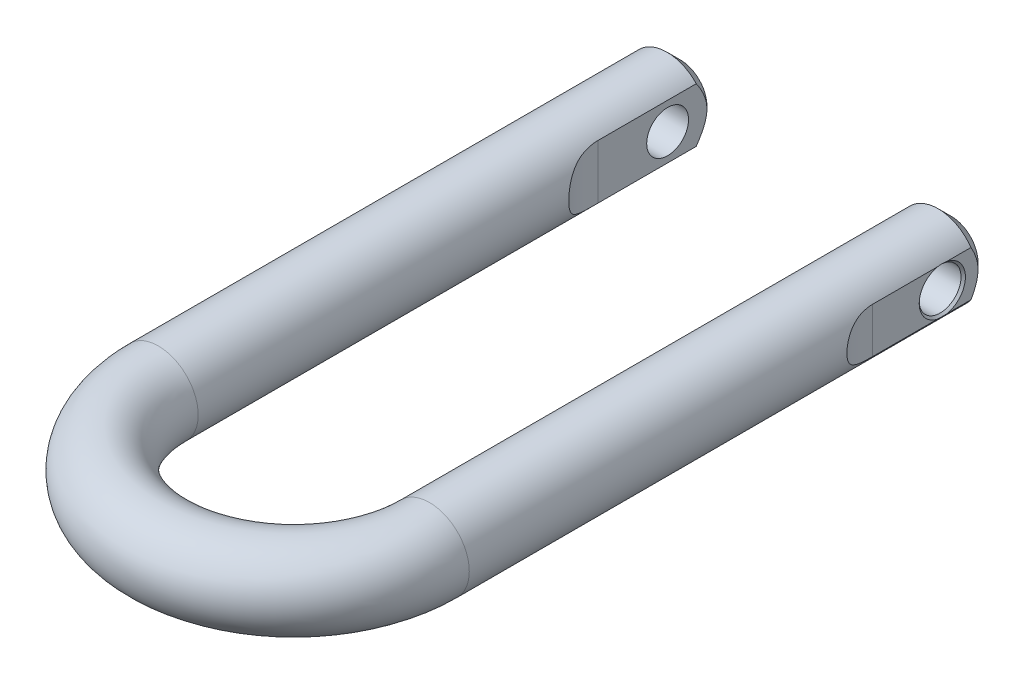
ISO-10303-21;
HEADER;
FILE_DESCRIPTION(('STEP AP214'),'2;1');
FILE_NAME('part.step','',(''),(''),'','','');
FILE_SCHEMA(('AUTOMOTIVE_DESIGN { 1 0 10303 214 1 1 1 1 }'));
ENDSEC;
DATA;
#1=APPLICATION_CONTEXT('core data for automotive mechanical design processes');
#2=APPLICATION_PROTOCOL_DEFINITION('international standard','automotive_design',2000,#1);
#3=PRODUCT_CONTEXT('',#1,'mechanical');
#4=PRODUCT('Part','Part','',(#3));
#5=PRODUCT_RELATED_PRODUCT_CATEGORY('part','',(#4));
#6=PRODUCT_DEFINITION_FORMATION('','',#4);
#7=PRODUCT_DEFINITION_CONTEXT('part definition',#1,'design');
#8=PRODUCT_DEFINITION('design','',#6,#7);
#9=PRODUCT_DEFINITION_SHAPE('','',#8);
#10=(LENGTH_UNIT() NAMED_UNIT(*) SI_UNIT(.MILLI.,.METRE.));
#11=(NAMED_UNIT(*) PLANE_ANGLE_UNIT() SI_UNIT($,.RADIAN.));
#12=(NAMED_UNIT(*) SI_UNIT($,.STERADIAN.) SOLID_ANGLE_UNIT());
#13=UNCERTAINTY_MEASURE_WITH_UNIT(LENGTH_MEASURE(1.E-05),#10,'distance_accuracy_value','');
#14=(GEOMETRIC_REPRESENTATION_CONTEXT(3) GLOBAL_UNCERTAINTY_ASSIGNED_CONTEXT((#13)) GLOBAL_UNIT_ASSIGNED_CONTEXT((#10,
#11,#12)) REPRESENTATION_CONTEXT('',''));
#15=CARTESIAN_POINT('',(0.,0.,0.));
#16=DIRECTION('',(0.,0.,1.));
#17=DIRECTION('',(1.,0.,0.));
#18=AXIS2_PLACEMENT_3D('',#15,#16,#17);
#19=CARTESIAN_POINT('',(-32.3977,0.,-10.0203));
#20=DIRECTION('',(0.,0.,-1.));
#21=DIRECTION('',(1.,0.,0.));
#22=AXIS2_PLACEMENT_3D('',#19,#20,#21);
#23=PLANE('',#22);
#24=CARTESIAN_POINT('',(-32.3977,0.,-10.0202999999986));
#25=DIRECTION('',(0.,0.,1.));
#26=DIRECTION('',(0.,-1.,0.));
#27=AXIS2_PLACEMENT_3D('',#24,#25,#26);
#28=CIRCLE('',#27,6.34999999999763);
#29=CARTESIAN_POINT('',(-32.3977,-6.34999999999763,-10.0202999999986));
#30=VERTEX_POINT('',#29);
#31=EDGE_CURVE('E220',#30,#30,#28,.T.);
#32=ORIENTED_EDGE('',*,*,#31,.F.);
#33=EDGE_LOOP('',(#32));
#34=FACE_BOUND('',#33,.T.);
#35=ADVANCED_FACE('F14',(#34),#23,.T.);
#36=CARTESIAN_POINT('',(-40.2336000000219,0.,0.));
#37=DIRECTION('',(-1.,0.,0.));
#38=DIRECTION('',(0.,-1.,0.));
#39=AXIS2_PLACEMENT_3D('',#36,#37,#38);
#40=CONICAL_SURFACE('',#39,5.52450000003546,0.785398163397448);
#41=CARTESIAN_POINT('',(-39.7090999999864,0.,0.));
#42=DIRECTION('',(-1.,0.,0.));
#43=DIRECTION('',(0.,-1.,0.));
#44=AXIS2_PLACEMENT_3D('',#41,#42,#43);
#45=CIRCLE('',#44,5.);
#46=CARTESIAN_POINT('',(-39.7090999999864,-5.,0.));
#47=VERTEX_POINT('',#46);
#48=EDGE_CURVE('E112',#47,#47,#45,.F.);
#49=ORIENTED_EDGE('',*,*,#48,.T.);
#50=EDGE_LOOP('',(#49));
#51=FACE_BOUND('',#50,.T.);
#52=CARTESIAN_POINT('',(-40.2336000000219,0.,0.));
#53=DIRECTION('',(-1.,0.,0.));
#54=DIRECTION('',(0.,-1.,0.));
#55=AXIS2_PLACEMENT_3D('',#52,#53,#54);
#56=CIRCLE('',#55,5.52450000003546);
#57=CARTESIAN_POINT('',(-40.2336000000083,-5.4151912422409,1.09352826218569));
#58=VERTEX_POINT('',#57);
#59=CARTESIAN_POINT('',(-40.2336000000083,5.4151912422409,1.0935282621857));
#60=VERTEX_POINT('',#59);
#61=EDGE_CURVE('E103',#58,#60,#56,.T.);
#62=ORIENTED_EDGE('',*,*,#61,.T.);
#63=CARTESIAN_POINT('',(-40.2335999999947,5.41519124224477,-1.09352826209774));
#64=CARTESIAN_POINT('',(-40.2187093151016,5.43669163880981,-0.912058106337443));
#65=CARTESIAN_POINT('',(-40.2074641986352,5.45282066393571,-0.729647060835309));
#66=CARTESIAN_POINT('',(-40.1924772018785,5.4742460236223,-0.364820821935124));
#67=CARTESIAN_POINT('',(-40.1886972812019,5.47959728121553,-0.182410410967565));
#68=CARTESIAN_POINT('',(-40.1886972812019,5.47959728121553,0.182410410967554));
#69=CARTESIAN_POINT('',(-40.1924772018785,5.4742460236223,0.364820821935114));
#70=CARTESIAN_POINT('',(-40.2074641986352,5.45282066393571,0.729647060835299));
#71=CARTESIAN_POINT('',(-40.2187093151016,5.43669163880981,0.912058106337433));
#72=CARTESIAN_POINT('',(-40.2335999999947,5.41519124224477,1.09352826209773));
#73=B_SPLINE_CURVE_WITH_KNOTS('',3,(#63,#64,#65,#66,#67,#68,#69,#70,#71,#72),.UNSPECIFIED.,.F.,
.F.,(4,2,2,2,4),(0.,0.549927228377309,1.09704488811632,1.64416254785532,2.19408977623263),.UNSPECIFIED.);
#74=CARTESIAN_POINT('',(-40.2336000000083,5.41519124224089,-1.09352826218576));
#75=VERTEX_POINT('',#74);
#76=EDGE_CURVE('E111',#75,#60,#73,.T.);
#77=ORIENTED_EDGE('',*,*,#76,.F.);
#78=CARTESIAN_POINT('',(-40.2336000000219,0.,0.));
#79=DIRECTION('',(-1.,0.,0.));
#80=DIRECTION('',(0.,-1.,0.));
#81=AXIS2_PLACEMENT_3D('',#78,#79,#80);
#82=CIRCLE('',#81,5.52450000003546);
#83=CARTESIAN_POINT('',(-40.2336000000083,-5.4151912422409,-1.09352826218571));
#84=VERTEX_POINT('',#83);
#85=EDGE_CURVE('E106',#75,#84,#82,.T.);
#86=ORIENTED_EDGE('',*,*,#85,.T.);
#87=CARTESIAN_POINT('',(-40.2335999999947,-5.41519124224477,1.09352826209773));
#88=CARTESIAN_POINT('',(-40.2187093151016,-5.43669163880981,0.912058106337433));
#89=CARTESIAN_POINT('',(-40.2074641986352,-5.45282066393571,0.729647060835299));
#90=CARTESIAN_POINT('',(-40.1924772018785,-5.4742460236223,0.364820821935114));
#91=CARTESIAN_POINT('',(-40.1886972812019,-5.47959728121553,0.182410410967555));
#92=CARTESIAN_POINT('',(-40.1886972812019,-5.47959728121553,-0.182410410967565));
#93=CARTESIAN_POINT('',(-40.1924772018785,-5.4742460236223,-0.364820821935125));
#94=CARTESIAN_POINT('',(-40.2074641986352,-5.45282066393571,-0.729647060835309));
#95=CARTESIAN_POINT('',(-40.2187093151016,-5.43669163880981,-0.912058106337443));
#96=CARTESIAN_POINT('',(-40.2335999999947,-5.41519124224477,-1.09352826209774));
#97=B_SPLINE_CURVE_WITH_KNOTS('',3,(#87,#88,#89,#90,#91,#92,#93,#94,#95,#96),.UNSPECIFIED.,.F.,
.F.,(4,2,2,2,4),(0.,0.549927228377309,1.09704488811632,1.64416254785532,2.19408977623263),.UNSPECIFIED.);
#98=EDGE_CURVE('E100',#58,#84,#97,.T.);
#99=ORIENTED_EDGE('',*,*,#98,.F.);
#100=EDGE_LOOP('',(#62,#77,#86,#99));
#101=FACE_BOUND('',#100,.T.);
#102=ADVANCED_FACE('F102',(#51,#101),#40,.F.);
#103=CARTESIAN_POINT('',(-40.2336,12.7,-47.3384957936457));
#104=DIRECTION('',(1.,0.,0.));
#105=DIRECTION('',(0.,1.,0.));
#106=AXIS2_PLACEMENT_3D('',#103,#104,#105);
#107=PLANE('',#106);
#108=ORIENTED_EDGE('',*,*,#61,.F.);
#109=DIRECTION('',(0.,0.,-1.));
#110=VECTOR('',#109,1.);
#111=CARTESIAN_POINT('',(-40.2336,-5.41519124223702,114.7572));
#112=LINE('',#111,#110);
#113=CARTESIAN_POINT('',(-40.2336,-5.41519124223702,16.6497));
#114=VERTEX_POINT('',#113);
#115=EDGE_CURVE('E116',#114,#58,#112,.T.);
#116=ORIENTED_EDGE('',*,*,#115,.F.);
#117=DIRECTION('',(0.,-1.,0.));
#118=VECTOR('',#117,1.);
#119=CARTESIAN_POINT('',(-40.2336,12.7,16.6497));
#120=LINE('',#119,#118);
#121=CARTESIAN_POINT('',(-40.2336,5.41519124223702,16.6497));
#122=VERTEX_POINT('',#121);
#123=EDGE_CURVE('E119',#114,#122,#120,.F.);
#124=ORIENTED_EDGE('',*,*,#123,.T.);
#125=DIRECTION('',(0.,0.,-1.));
#126=VECTOR('',#125,1.);
#127=CARTESIAN_POINT('',(-40.2336,5.41519124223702,114.7572));
#128=LINE('',#127,#126);
#129=EDGE_CURVE('E118',#60,#122,#128,.F.);
#130=ORIENTED_EDGE('',*,*,#129,.F.);
#131=EDGE_LOOP('',(#108,#116,#124,#130));
#132=FACE_BOUND('',#131,.T.);
#133=ADVANCED_FACE('F115',(#132),#107,.F.);
#134=CARTESIAN_POINT('',(-59.2836,12.7,16.6497));
#135=DIRECTION('',(0.,-1.,0.));
#136=DIRECTION('',(1.,0.,0.));
#137=AXIS2_PLACEMENT_3D('',#134,#135,#136);
#138=CYLINDRICAL_SURFACE('',#137,19.05);
#139=ORIENTED_EDGE('',*,*,#123,.F.);
#140=CARTESIAN_POINT('',(-40.2336,5.41519124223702,16.6497));
#141=CARTESIAN_POINT('',(-40.23359900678,5.41518695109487,16.785931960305));
#142=CARTESIAN_POINT('',(-40.2350617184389,5.41307691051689,16.9221505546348));
#143=CARTESIAN_POINT('',(-40.2409021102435,5.4046131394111,17.1943950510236));
#144=CARTESIAN_POINT('',(-40.2452798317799,5.39825934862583,17.3304209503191));
#145=CARTESIAN_POINT('',(-40.2627755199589,5.37277142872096,17.7381583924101));
#146=CARTESIAN_POINT('',(-40.2802559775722,5.34721065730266,18.0093250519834));
#147=CARTESIAN_POINT('',(-40.3267438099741,5.27803344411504,18.5509347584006));
#148=CARTESIAN_POINT('',(-40.3558576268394,5.23425011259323,18.8213472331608));
#149=CARTESIAN_POINT('',(-40.4250101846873,5.12757013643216,19.3568948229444));
#150=CARTESIAN_POINT('',(-40.4650443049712,5.06468157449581,19.6220321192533));
#151=CARTESIAN_POINT('',(-40.5458033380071,4.93342259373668,20.0908979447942));
#152=CARTESIAN_POINT('',(-40.5846830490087,4.86885750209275,20.2960141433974));
#153=CARTESIAN_POINT('',(-40.6680492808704,4.72586566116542,20.7001710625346));
#154=CARTESIAN_POINT('',(-40.7125345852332,4.64744191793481,20.8992130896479));
#155=CARTESIAN_POINT('',(-40.8060742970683,4.47597765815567,21.2890505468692));
#156=CARTESIAN_POINT('',(-40.8551138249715,4.3829841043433,21.4798700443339));
#157=CARTESIAN_POINT('',(-40.956662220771,4.18121149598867,21.8519180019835));
#158=CARTESIAN_POINT('',(-41.0091698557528,4.07243803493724,22.0331498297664));
#159=CARTESIAN_POINT('',(-41.1397606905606,3.7863631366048,22.461159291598));
#160=CARTESIAN_POINT('',(-41.2189294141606,3.59997089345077,22.7016803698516));
#161=CARTESIAN_POINT('',(-41.3752394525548,3.19019310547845,23.1496529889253));
#162=CARTESIAN_POINT('',(-41.452382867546,2.96684779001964,23.3571400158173));
#163=CARTESIAN_POINT('',(-41.5830217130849,2.52925082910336,23.6937276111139));
#164=CARTESIAN_POINT('',(-41.6382292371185,2.32128223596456,23.8302315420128));
#165=CARTESIAN_POINT('',(-41.7124430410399,1.99343843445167,24.0091242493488));
#166=CARTESIAN_POINT('',(-41.7357529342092,1.88147794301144,24.064455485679));
#167=CARTESIAN_POINT('',(-41.7789248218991,1.65280279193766,24.1658079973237));
#168=CARTESIAN_POINT('',(-41.7987884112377,1.53609036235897,24.2118335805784));
#169=CARTESIAN_POINT('',(-41.8336668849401,1.30431108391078,24.2919610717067));
#170=CARTESIAN_POINT('',(-41.8488684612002,1.18943324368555,24.3265285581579));
#171=CARTESIAN_POINT('',(-41.87524164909,0.956827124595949,24.386147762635));
#172=CARTESIAN_POINT('',(-41.8864151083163,0.839100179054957,24.4112038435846));
#173=CARTESIAN_POINT('',(-41.9044244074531,0.601655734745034,24.4514461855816));
#174=CARTESIAN_POINT('',(-41.9112608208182,0.481938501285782,24.4666337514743));
#175=CARTESIAN_POINT('',(-41.9203984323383,0.241479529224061,24.4869097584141));
#176=CARTESIAN_POINT('',(-41.9226998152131,0.120737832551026,24.4919986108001));
#177=CARTESIAN_POINT('',(-41.9227001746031,-0.114083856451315,24.4919990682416));
#178=CARTESIAN_POINT('',(-41.9206458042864,-0.228164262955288,24.4874560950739));
#179=CARTESIAN_POINT('',(-41.9124826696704,-0.455498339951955,24.4693471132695));
#180=CARTESIAN_POINT('',(-41.9063724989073,-0.568751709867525,24.4557779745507));
#181=CARTESIAN_POINT('',(-41.8902565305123,-0.793524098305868,24.4198023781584));
#182=CARTESIAN_POINT('',(-41.8802521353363,-0.905043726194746,24.3973991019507));
#183=CARTESIAN_POINT('',(-41.8566051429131,-1.12564487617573,24.3440611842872));
#184=CARTESIAN_POINT('',(-41.8429611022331,-1.23472541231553,24.3131231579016));
#185=CARTESIAN_POINT('',(-41.7971758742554,-1.55629596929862,24.2083577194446));
#186=CARTESIAN_POINT('',(-41.7600941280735,-1.76426354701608,24.1223902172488));
#187=CARTESIAN_POINT('',(-41.6759782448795,-2.16356456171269,23.9219706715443));
#188=CARTESIAN_POINT('',(-41.6289398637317,-2.35489085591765,23.8075064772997));
#189=CARTESIAN_POINT('',(-41.5096203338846,-2.7866950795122,23.5070263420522));
#190=CARTESIAN_POINT('',(-41.4344663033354,-3.01890400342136,23.3102444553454));
#191=CARTESIAN_POINT('',(-41.2802434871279,-3.44645272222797,22.8813603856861));
#192=CARTESIAN_POINT('',(-41.201168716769,-3.6417338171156,22.6492030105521));
#193=CARTESIAN_POINT('',(-41.070625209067,-3.93995940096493,22.2372621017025));
#194=CARTESIAN_POINT('',(-41.0184139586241,-4.05246310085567,22.0644674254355));
#195=CARTESIAN_POINT('',(-40.9167538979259,-4.26203374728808,21.7089108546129));
#196=CARTESIAN_POINT('',(-40.8673060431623,-4.35909537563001,21.5261455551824));
#197=CARTESIAN_POINT('',(-40.7722698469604,-4.53900772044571,21.1519845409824));
#198=CARTESIAN_POINT('',(-40.726695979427,-4.6218062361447,20.9605602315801));
#199=CARTESIAN_POINT('',(-40.6405533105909,-4.77374117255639,20.571316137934));
#200=CARTESIAN_POINT('',(-40.5999844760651,-4.84287768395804,20.3734963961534));
#201=CARTESIAN_POINT('',(-40.5090770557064,-4.99418968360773,19.8904433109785));
#202=CARTESIAN_POINT('',(-40.4615713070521,-5.07005435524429,19.6026838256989));
#203=CARTESIAN_POINT('',(-40.3793589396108,-5.19851219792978,19.0201145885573));
#204=CARTESIAN_POINT('',(-40.3446612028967,-5.25108922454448,18.7253000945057));
#205=CARTESIAN_POINT('',(-40.2892542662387,-5.3339912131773,18.1344278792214));
#206=CARTESIAN_POINT('',(-40.2684021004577,-5.36454388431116,17.8384156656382));
#207=CARTESIAN_POINT('',(-40.2475326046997,-5.39498641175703,17.3931525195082));
#208=CARTESIAN_POINT('',(-40.2423109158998,-5.40256956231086,17.2446126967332));
#209=CARTESIAN_POINT('',(-40.2353440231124,-5.41266876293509,16.9472877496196));
#210=CARTESIAN_POINT('',(-40.2335986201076,-5.41518510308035,16.7985026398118));
#211=CARTESIAN_POINT('',(-40.2336,-5.41519124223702,16.6497));
#212=B_SPLINE_CURVE_WITH_KNOTS('',3,(#140,#141,#142,#143,#144,#145,#146,#147,#148,#149,#150,
#151,#152,#153,#154,#155,#156,#157,#158,#159,#160,#161,#162,#163,#164,#165,#166,#167,#168,#169,
#170,#171,#172,#173,#174,#175,#176,#177,#178,#179,#180,#181,#182,#183,#184,#185,#186,#187,#188,
#189,#190,#191,#192,#193,#194,#195,#196,#197,#198,#199,#200,#201,#202,#203,#204,#205,#206,#207,
#208,#209,#210,#211),.UNSPECIFIED.,.F.,.F.,(4,2,2,2,2,2,2,2,2,2,2,2,2,2,2,2,2,2,2,2,2,2,2,2,2,2,
2,2,2,2,2,2,2,2,2,4),(0.,0.408644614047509,0.817295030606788,1.635208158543,2.46078291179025,
3.28600888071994,3.94104581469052,4.59594083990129,5.2487668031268,5.90136192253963,
6.84116993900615,7.77996147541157,8.54102710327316,8.92175516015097,9.30230655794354,
9.66462771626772,10.0267824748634,10.388889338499,10.7509814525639,11.0931183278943,
11.4353739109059,11.7775063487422,12.1197746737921,12.8008521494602,13.4822205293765,
14.4176193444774,15.3544927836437,15.991804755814,16.6293357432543,17.2691525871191,
17.9089651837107,18.8116125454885,19.7148847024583,20.6086785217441,21.0550448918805,
21.5013857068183),.UNSPECIFIED.);
#213=EDGE_CURVE('E124',#122,#114,#212,.T.);
#214=ORIENTED_EDGE('',*,*,#213,.F.);
#215=EDGE_LOOP('',(#139,#214));
#216=FACE_BOUND('',#215,.T.);
#217=ADVANCED_FACE('F237',(#216),#138,.F.);
#218=CARTESIAN_POINT('',(-6.3754,12.7,16.6497));
#219=DIRECTION('',(0.,-1.,0.));
#220=DIRECTION('',(1.,0.,0.));
#221=AXIS2_PLACEMENT_3D('',#218,#219,#220);
#222=CYLINDRICAL_SURFACE('',#221,19.05);
#223=CARTESIAN_POINT('',(-25.4254,-6.48942660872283,16.6497));
#224=CARTESIAN_POINT('',(-25.4254031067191,-6.48941915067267,16.8191491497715));
#225=CARTESIAN_POINT('',(-25.4231391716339,-6.48699726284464,16.9885981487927));
#226=CARTESIAN_POINT('',(-25.4140999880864,-6.47727078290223,17.3272427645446));
#227=CARTESIAN_POINT('',(-25.4073245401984,-6.46996597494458,17.4964383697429));
#228=CARTESIAN_POINT('',(-25.3892753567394,-6.45040923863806,17.8344906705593));
#229=CARTESIAN_POINT('',(-25.3779967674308,-6.43815197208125,18.003346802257));
#230=CARTESIAN_POINT('',(-25.3509928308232,-6.40858295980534,18.3402468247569));
#231=CARTESIAN_POINT('',(-25.3352675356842,-6.39127127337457,18.508290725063));
#232=CARTESIAN_POINT('',(-25.2811865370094,-6.3311821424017,19.0138506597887));
#233=CARTESIAN_POINT('',(-25.2360883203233,-6.28041976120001,19.3497645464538));
#234=CARTESIAN_POINT('',(-25.1289138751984,-6.15606363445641,20.0144349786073));
#235=CARTESIAN_POINT('',(-25.0668465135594,-6.08248180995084,20.3431951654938));
#236=CARTESIAN_POINT('',(-24.9446248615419,-5.93162471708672,20.9097679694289));
#237=CARTESIAN_POINT('',(-24.8878642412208,-5.85986156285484,21.149788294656));
#238=CARTESIAN_POINT('',(-24.7664754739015,-5.70088207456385,21.6226659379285));
#239=CARTESIAN_POINT('',(-24.7018472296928,-5.6136655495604,21.8555231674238));
#240=CARTESIAN_POINT('',(-24.5661410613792,-5.42272814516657,22.3114874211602));
#241=CARTESIAN_POINT('',(-24.4950851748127,-5.31906280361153,22.5346241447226));
#242=CARTESIAN_POINT('',(-24.347921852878,-5.09360536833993,22.9697990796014));
#243=CARTESIAN_POINT('',(-24.2718160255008,-4.97181902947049,23.1818407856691));
#244=CARTESIAN_POINT('',(-24.1369128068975,-4.74317552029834,23.538638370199));
#245=CARTESIAN_POINT('',(-24.0787925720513,-4.64074028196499,23.6864914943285));
#246=CARTESIAN_POINT('',(-23.9619532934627,-4.42480243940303,23.9736090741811));
#247=CARTESIAN_POINT('',(-23.9032344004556,-4.31130256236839,24.1128756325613));
#248=CARTESIAN_POINT('',(-23.7864121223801,-4.07295041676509,24.3814907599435));
#249=CARTESIAN_POINT('',(-23.7283083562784,-3.94810569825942,24.5108458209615));
#250=CARTESIAN_POINT('',(-23.6140719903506,-3.68698467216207,24.758293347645));
#251=CARTESIAN_POINT('',(-23.5579390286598,-3.55071047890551,24.8763878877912));
#252=CARTESIAN_POINT('',(-23.414919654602,-3.17747214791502,25.1701518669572));
#253=CARTESIAN_POINT('',(-23.3308259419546,-2.93096224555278,25.3354769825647));
#254=CARTESIAN_POINT('',(-23.2169020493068,-2.54106543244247,25.5532440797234));
#255=CARTESIAN_POINT('',(-23.1809506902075,-2.40768274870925,25.6208189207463));
#256=CARTESIAN_POINT('',(-23.1139595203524,-2.13482510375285,25.7451986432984));
#257=CARTESIAN_POINT('',(-23.0829173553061,-1.99535310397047,25.8020086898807));
#258=CARTESIAN_POINT('',(-23.0256456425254,-1.70662532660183,25.9058038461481));
#259=CARTESIAN_POINT('',(-22.9996007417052,-1.55719943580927,25.9524186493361));
#260=CARTESIAN_POINT('',(-22.9543513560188,-1.25391083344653,26.0328233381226));
#261=CARTESIAN_POINT('',(-22.9351469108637,-1.10004809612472,26.0666131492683));
#262=CARTESIAN_POINT('',(-22.9041732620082,-0.789273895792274,26.1208739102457));
#263=CARTESIAN_POINT('',(-22.8924028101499,-0.632362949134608,26.1413470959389));
#264=CARTESIAN_POINT('',(-22.8766662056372,-0.316968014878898,26.168679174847));
#265=CARTESIAN_POINT('',(-22.8726999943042,-0.158484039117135,26.1755381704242));
#266=CARTESIAN_POINT('',(-22.8727000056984,0.15855862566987,26.1755381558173));
#267=CARTESIAN_POINT('',(-22.8766699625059,0.317117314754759,26.1686726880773));
#268=CARTESIAN_POINT('',(-22.8924212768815,0.632658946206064,26.1413149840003));
#269=CARTESIAN_POINT('',(-22.9042026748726,0.789641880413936,26.1208226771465));
#270=CARTESIAN_POINT('',(-22.9352053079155,1.10056092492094,26.0665105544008));
#271=CARTESIAN_POINT('',(-22.9544280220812,1.25449642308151,26.0326880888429));
#272=CARTESIAN_POINT('',(-22.9997198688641,1.55792583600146,25.9522059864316));
#273=CARTESIAN_POINT('',(-23.0257890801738,1.7074196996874,25.9055462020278));
#274=CARTESIAN_POINT('',(-23.0838309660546,1.99988774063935,25.8003506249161));
#275=CARTESIAN_POINT('',(-23.1157658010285,2.14289677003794,25.7418907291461));
#276=CARTESIAN_POINT('',(-23.184776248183,2.42248705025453,25.6136663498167));
#277=CARTESIAN_POINT('',(-23.2218545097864,2.55906493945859,25.5438960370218));
#278=CARTESIAN_POINT('',(-23.339410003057,2.95798108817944,25.3188031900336));
#279=CARTESIAN_POINT('',(-23.4262573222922,3.20973856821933,25.1476120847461));
#280=CARTESIAN_POINT('',(-23.5743427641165,3.59148121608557,24.8421266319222));
#281=CARTESIAN_POINT('',(-23.6327938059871,3.73142424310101,24.7184803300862));
#282=CARTESIAN_POINT('',(-23.7516229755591,3.9990455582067,24.4592882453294));
#283=CARTESIAN_POINT('',(-23.8120015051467,4.12672126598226,24.3237399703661));
#284=CARTESIAN_POINT('',(-23.9332094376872,4.36995768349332,24.0422191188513));
#285=CARTESIAN_POINT('',(-23.994039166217,4.48550849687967,23.8962381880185));
#286=CARTESIAN_POINT('',(-24.1148288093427,4.7048206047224,23.5953085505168));
#287=CARTESIAN_POINT('',(-24.1747884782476,4.80857862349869,23.4403573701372));
#288=CARTESIAN_POINT('',(-24.3142336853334,5.04059925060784,23.0648461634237));
#289=CARTESIAN_POINT('',(-24.3928687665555,5.1640055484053,22.8409612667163));
#290=CARTESIAN_POINT('',(-24.5442221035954,5.39139740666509,22.3816242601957));
#291=CARTESIAN_POINT('',(-24.6169382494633,5.4953760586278,22.1461680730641));
#292=CARTESIAN_POINT('',(-24.7549729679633,5.68579087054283,21.6653303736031));
#293=CARTESIAN_POINT('',(-24.8202686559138,5.7721733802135,21.4199211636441));
#294=CARTESIAN_POINT('',(-24.9419735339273,5.928538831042,20.9217765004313));
#295=CARTESIAN_POINT('',(-24.998380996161,5.9985185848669,20.6690396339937));
#296=CARTESIAN_POINT('',(-25.1113421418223,6.13546885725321,20.108553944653));
#297=CARTESIAN_POINT('',(-25.1658211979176,6.19924952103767,19.7996054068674));
#298=CARTESIAN_POINT('',(-25.2597799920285,6.30720410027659,19.1760041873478));
#299=CARTESIAN_POINT('',(-25.2992548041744,6.35137157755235,18.8613496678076));
#300=CARTESIAN_POINT('',(-25.3622549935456,6.42108503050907,18.2312140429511));
#301=CARTESIAN_POINT('',(-25.3859175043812,6.44679126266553,17.9157645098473));
#302=CARTESIAN_POINT('',(-25.4095964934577,6.47241430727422,17.441490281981));
#303=CARTESIAN_POINT('',(-25.4155203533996,6.4787992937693,17.2832622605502));
#304=CARTESIAN_POINT('',(-25.4234225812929,6.48730290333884,16.9665943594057));
#305=CARTESIAN_POINT('',(-25.4254009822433,6.48942156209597,16.808154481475));
#306=CARTESIAN_POINT('',(-25.4254,6.48942660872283,16.6497));
#307=B_SPLINE_CURVE_WITH_KNOTS('',3,(#223,#224,#225,#226,#227,#228,#229,#230,#231,#232,#233,
#234,#235,#236,#237,#238,#239,#240,#241,#242,#243,#244,#245,#246,#247,#248,#249,#250,#251,#252,
#253,#254,#255,#256,#257,#258,#259,#260,#261,#262,#263,#264,#265,#266,#267,#268,#269,#270,#271,
#272,#273,#274,#275,#276,#277,#278,#279,#280,#281,#282,#283,#284,#285,#286,#287,#288,#289,#290,
#291,#292,#293,#294,#295,#296,#297,#298,#299,#300,#301,#302,#303,#304,#305,#306),.UNSPECIFIED.,
.F.,.F.,(4,2,2,2,2,2,2,2,2,2,2,2,2,2,2,2,2,2,2,2,2,2,2,2,2,2,2,2,2,2,2,2,2,2,2,2,2,2,2,2,2,4),
(0.,0.508314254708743,1.01665098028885,1.5255371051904,2.03441726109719,3.06126918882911,
4.0875855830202,4.85757931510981,5.6275825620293,6.39503922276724,7.16225267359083,
7.72887307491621,8.29535416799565,8.86146098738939,9.42746331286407,10.3484578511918,
10.8093520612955,11.2700245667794,11.7453610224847,12.2207002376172,12.6959596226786,
13.1712154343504,13.6466949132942,14.1221768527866,14.5977533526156,15.0733353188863,
15.5459506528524,16.0188103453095,16.9637691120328,17.5501629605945,18.1366798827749,
18.723671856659,19.3108264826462,20.1120324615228,20.9135228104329,21.7174214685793,
22.5214762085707,23.4807776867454,24.4403938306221,25.3915756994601,25.866887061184,
26.3421944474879),.UNSPECIFIED.);
#308=CARTESIAN_POINT('',(-25.4254,-6.48942660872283,16.6497));
#309=VERTEX_POINT('',#308);
#310=CARTESIAN_POINT('',(-25.4254,6.48942660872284,16.6497));
#311=VERTEX_POINT('',#310);
#312=EDGE_CURVE('E241',#309,#311,#307,.T.);
#313=ORIENTED_EDGE('',*,*,#312,.F.);
#314=DIRECTION('',(0.,-1.,0.));
#315=VECTOR('',#314,1.);
#316=CARTESIAN_POINT('',(-25.4254,12.7,16.6497));
#317=LINE('',#316,#315);
#318=EDGE_CURVE('E144',#309,#311,#317,.F.);
#319=ORIENTED_EDGE('',*,*,#318,.T.);
#320=EDGE_LOOP('',(#313,#319));
#321=FACE_BOUND('',#320,.T.);
#322=ADVANCED_FACE('F233',(#321),#222,.F.);
#323=CARTESIAN_POINT('',(-25.4254,12.7,-17.2148171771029));
#324=DIRECTION('',(-1.,0.,0.));
#325=DIRECTION('',(0.,-1.,0.));
#326=AXIS2_PLACEMENT_3D('',#323,#324,#325);
#327=PLANE('',#326);
#328=CARTESIAN_POINT('',(-25.4254,0.,0.));
#329=DIRECTION('',(-1.,0.,0.));
#330=DIRECTION('',(0.,-1.,0.));
#331=AXIS2_PLACEMENT_3D('',#328,#329,#330);
#332=CIRCLE('',#331,5.);
#333=CARTESIAN_POINT('',(-25.4254,-5.,0.));
#334=VERTEX_POINT('',#333);
#335=EDGE_CURVE('E528',#334,#334,#332,.T.);
#336=ORIENTED_EDGE('',*,*,#335,.T.);
#337=EDGE_LOOP('',(#336));
#338=FACE_BOUND('',#337,.T.);
#339=ORIENTED_EDGE('',*,*,#318,.F.);
#340=DIRECTION('',(0.,0.,1.));
#341=VECTOR('',#340,1.);
#342=CARTESIAN_POINT('',(-25.4254,-6.48942660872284,-17.2148171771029));
#343=LINE('',#342,#341);
#344=CARTESIAN_POINT('',(-25.4254,-6.48942660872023,-6.84529999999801));
#345=VERTEX_POINT('',#344);
#346=EDGE_CURVE('E141',#345,#309,#343,.T.);
#347=ORIENTED_EDGE('',*,*,#346,.F.);
#348=CARTESIAN_POINT('',(-25.4254,6.4894266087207,-6.84529999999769));
#349=CARTESIAN_POINT('',(-25.4254,6.32995790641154,-6.95392500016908));
#350=CARTESIAN_POINT('',(-25.4254,6.16949937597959,-7.06112077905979));
#351=CARTESIAN_POINT('',(-25.4254,5.84629987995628,-7.27210839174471));
#352=CARTESIAN_POINT('',(-25.4254,5.68355830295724,-7.37589928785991));
#353=CARTESIAN_POINT('',(-25.4254,5.35457370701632,-7.58009424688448));
#354=CARTESIAN_POINT('',(-25.4254,5.18831535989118,-7.68047371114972));
#355=CARTESIAN_POINT('',(-25.4254,4.85299655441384,-7.87641847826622));
#356=CARTESIAN_POINT('',(-25.4254,4.68393629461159,-7.97198412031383));
#357=CARTESIAN_POINT('',(-25.4254,4.33700838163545,-8.16050673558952));
#358=CARTESIAN_POINT('',(-25.4254,4.1590349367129,-8.25327077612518));
#359=CARTESIAN_POINT('',(-25.4254,3.79947441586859,-8.43149725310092));
#360=CARTESIAN_POINT('',(-25.4254,3.61788690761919,-8.51695880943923));
#361=CARTESIAN_POINT('',(-25.4254,3.06810644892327,-8.75989307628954));
#362=CARTESIAN_POINT('',(-25.4254,2.69389598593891,-8.90447586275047));
#363=CARTESIAN_POINT('',(-25.4254,2.10173718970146,-9.09084272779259));
#364=CARTESIAN_POINT('',(-25.4254,1.88910977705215,-9.14962915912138));
#365=CARTESIAN_POINT('',(-25.4254,1.45972003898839,-9.2498924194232));
#366=CARTESIAN_POINT('',(-25.4254,1.24295752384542,-9.29136845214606));
#367=CARTESIAN_POINT('',(-25.4254,0.809413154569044,-9.35440676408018));
#368=CARTESIAN_POINT('',(-25.4254,0.592668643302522,-9.37622243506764));
#369=CARTESIAN_POINT('',(-25.4254,0.158086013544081,-9.3995824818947));
#370=CARTESIAN_POINT('',(-25.4254,-0.0597520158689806,-9.40112848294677));
#371=CARTESIAN_POINT('',(-25.4254,-0.494780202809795,-9.3838498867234));
#372=CARTESIAN_POINT('',(-25.4254,-0.711969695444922,-9.36500884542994));
#373=CARTESIAN_POINT('',(-25.4254,-1.14378943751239,-9.30805010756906));
#374=CARTESIAN_POINT('',(-25.4254,-1.3584193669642,-9.26993002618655));
#375=CARTESIAN_POINT('',(-25.4254,-1.78658388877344,-9.17581403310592));
#376=CARTESIAN_POINT('',(-25.4254,-2.00006835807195,-9.11959316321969));
#377=CARTESIAN_POINT('',(-25.4254,-2.42236617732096,-8.99193316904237));
#378=CARTESIAN_POINT('',(-25.4254,-2.63117957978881,-8.92049421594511));
#379=CARTESIAN_POINT('',(-25.4254,-3.16806360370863,-8.71812632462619));
#380=CARTESIAN_POINT('',(-25.4254,-3.4923723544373,-8.57725009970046));
#381=CARTESIAN_POINT('',(-25.4254,-4.12977822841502,-8.2715580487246));
#382=CARTESIAN_POINT('',(-25.4254,-4.44285934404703,-8.10670961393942));
#383=CARTESIAN_POINT('',(-25.4254,-4.90019882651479,-7.84916083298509));
#384=CARTESIAN_POINT('',(-25.4254,-5.04825661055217,-7.76309435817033));
#385=CARTESIAN_POINT('',(-25.4254,-5.34227141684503,-7.58742393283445));
#386=CARTESIAN_POINT('',(-25.4254,-5.48822834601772,-7.49781982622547));
#387=CARTESIAN_POINT('',(-25.4254,-5.77772532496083,-7.31588470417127));
#388=CARTESIAN_POINT('',(-25.4254,-5.9212719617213,-7.22356412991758));
#389=CARTESIAN_POINT('',(-25.4254,-6.20661280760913,-7.0363037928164));
#390=CARTESIAN_POINT('',(-25.4254,-6.34840731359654,-6.94136448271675));
#391=CARTESIAN_POINT('',(-25.4254,-6.48942660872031,-6.84529999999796));
#392=B_SPLINE_CURVE_WITH_KNOTS('',3,(#348,#349,#350,#351,#352,#353,#354,#355,#356,#357,#358,
#359,#360,#361,#362,#363,#364,#365,#366,#367,#368,#369,#370,#371,#372,#373,#374,#375,#376,#377,
#378,#379,#380,#381,#382,#383,#384,#385,#386,#387,#388,#389,#390,#391),.UNSPECIFIED.,.F.,.F.,(4,
2,2,2,2,2,2,2,2,2,2,2,2,2,2,2,2,2,2,2,2,4),(0.,0.578861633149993,1.15788136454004,
1.74044268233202,2.32296289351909,2.92488701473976,3.52688357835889,4.72744866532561,
5.38868360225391,6.04994895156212,6.70256439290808,7.35512750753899,8.00821736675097,
8.6613880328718,9.32301180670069,9.98462813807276,11.0439353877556,12.1046973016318,
12.6184267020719,13.1321787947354,13.6441635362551,14.1560603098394),.UNSPECIFIED.);
#393=CARTESIAN_POINT('',(-25.4254,6.48942660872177,-6.84529999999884));
#394=VERTEX_POINT('',#393);
#395=EDGE_CURVE('E146',#394,#345,#392,.T.);
#396=ORIENTED_EDGE('',*,*,#395,.F.);
#397=DIRECTION('',(0.,0.,-1.));
#398=VECTOR('',#397,1.);
#399=CARTESIAN_POINT('',(-25.4254,6.48942660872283,114.7572));
#400=LINE('',#399,#398);
#401=EDGE_CURVE('E138',#311,#394,#400,.T.);
#402=ORIENTED_EDGE('',*,*,#401,.F.);
#403=EDGE_LOOP('',(#339,#347,#396,#402));
#404=FACE_BOUND('',#403,.T.);
#405=ADVANCED_FACE('F229',(#338,#404),#327,.F.);
#406=CARTESIAN_POINT('',(-32.3977,0.,-6.84529999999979));
#407=DIRECTION('',(0.,0.,1.));
#408=DIRECTION('',(0.,-1.,0.));
#409=AXIS2_PLACEMENT_3D('',#406,#407,#408);
#410=CONICAL_SURFACE('',#409,9.52499999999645,0.785398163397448);
#411=ORIENTED_EDGE('',*,*,#31,.T.);
#412=EDGE_LOOP('',(#411));
#413=FACE_BOUND('',#412,.T.);
#414=CARTESIAN_POINT('',(-40.2336,-5.4151912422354,-6.84529999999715));
#415=CARTESIAN_POINT('',(-40.2336,-5.27410364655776,-6.92550063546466));
#416=CARTESIAN_POINT('',(-40.2336,-5.13210356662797,-7.00412014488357));
#417=CARTESIAN_POINT('',(-40.2336,-4.8461054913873,-7.15772932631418));
#418=CARTESIAN_POINT('',(-40.2336,-4.7021069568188,-7.23271799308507));
#419=CARTESIAN_POINT('',(-40.2336,-4.41143066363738,-7.37884775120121));
#420=CARTESIAN_POINT('',(-40.2336,-4.26474443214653,-7.44997207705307));
#421=CARTESIAN_POINT('',(-40.2336,-3.96917047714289,-7.58744544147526));
#422=CARTESIAN_POINT('',(-40.2336,-3.82028291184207,-7.65379482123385));
#423=CARTESIAN_POINT('',(-40.2336,-3.36643873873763,-7.84630562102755));
#424=CARTESIAN_POINT('',(-40.2336,-3.05784812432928,-7.96411115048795));
#425=CARTESIAN_POINT('',(-40.2336,-2.43154174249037,-8.17110673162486));
#426=CARTESIAN_POINT('',(-40.2336,-2.11384136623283,-8.26034226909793));
#427=CARTESIAN_POINT('',(-40.2336,-1.56242081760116,-8.38329404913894));
#428=CARTESIAN_POINT('',(-40.2336,-1.33061604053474,-8.42558724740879));
#429=CARTESIAN_POINT('',(-40.2336,-0.864182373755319,-8.49027088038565));
#430=CARTESIAN_POINT('',(-40.2336,-0.629553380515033,-8.51266058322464));
#431=CARTESIAN_POINT('',(-40.2336,-0.160922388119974,-8.53621662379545));
#432=CARTESIAN_POINT('',(-40.2336,0.073071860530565,-8.53753537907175));
#433=CARTESIAN_POINT('',(-40.2336,0.540230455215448,-8.51926868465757));
#434=CARTESIAN_POINT('',(-40.2336,0.773394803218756,-8.49968328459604));
#435=CARTESIAN_POINT('',(-40.2336,1.23611696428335,-8.4408074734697));
#436=CARTESIAN_POINT('',(-40.2336,1.46568627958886,-8.40160605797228));
#437=CARTESIAN_POINT('',(-40.2336,1.9210440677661,-8.30542734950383));
#438=CARTESIAN_POINT('',(-40.2336,2.1468321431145,-8.24844819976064));
#439=CARTESIAN_POINT('',(-40.2336,2.5952237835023,-8.11862415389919));
#440=CARTESIAN_POINT('',(-40.2336,2.81780001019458,-8.04568584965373));
#441=CARTESIAN_POINT('',(-40.2336,3.25808593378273,-7.88653215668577));
#442=CARTESIAN_POINT('',(-40.2336,3.47579587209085,-7.80031742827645));
#443=CARTESIAN_POINT('',(-40.2336,3.9884420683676,-7.58186634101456));
#444=CARTESIAN_POINT('',(-40.2336,4.28123405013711,-7.44460288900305));
#445=CARTESIAN_POINT('',(-40.2336,4.71268658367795,-7.22723961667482));
#446=CARTESIAN_POINT('',(-40.2336,4.85451216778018,-7.15327896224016));
#447=CARTESIAN_POINT('',(-40.2336,5.13624643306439,-7.0018274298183));
#448=CARTESIAN_POINT('',(-40.2336,5.27615533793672,-6.92433696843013));
#449=CARTESIAN_POINT('',(-40.2336,5.41519124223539,-6.84529999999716));
#450=B_SPLINE_CURVE_WITH_KNOTS('',3,(#414,#415,#416,#417,#418,#419,#420,#421,#422,#423,#424,
#425,#426,#427,#428,#429,#430,#431,#432,#433,#434,#435,#436,#437,#438,#439,#440,#441,#442,#443,
#444,#445,#446,#447,#448,#449),.UNSPECIFIED.,.F.,.F.,(4,2,2,2,2,2,2,2,2,2,2,2,2,2,2,2,2,4),(0.,
0.486874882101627,0.973883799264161,1.46285994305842,1.9518011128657,2.9416175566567,
3.92985020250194,4.63598395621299,5.3421436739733,6.04319302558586,6.74424071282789,
7.44213628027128,8.14010476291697,8.842273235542,9.54440679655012,10.5137719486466,
10.9935935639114,11.4733586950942),.UNSPECIFIED.);
#451=CARTESIAN_POINT('',(-40.2336,-5.41519124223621,-6.84529999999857));
#452=VERTEX_POINT('',#451);
#453=CARTESIAN_POINT('',(-40.2336,5.41519124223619,-6.84529999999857));
#454=VERTEX_POINT('',#453);
#455=EDGE_CURVE('E214',#452,#454,#450,.T.);
#456=ORIENTED_EDGE('',*,*,#455,.T.);
#457=CARTESIAN_POINT('',(-32.3977,0.,-6.8453));
#458=DIRECTION('',(0.,0.,-1.));
#459=DIRECTION('',(1.,0.,0.));
#460=AXIS2_PLACEMENT_3D('',#457,#458,#459);
#461=CIRCLE('',#460,9.525);
#462=EDGE_CURVE('E134',#394,#454,#461,.F.);
#463=ORIENTED_EDGE('',*,*,#462,.F.);
#464=ORIENTED_EDGE('',*,*,#395,.T.);
#465=CARTESIAN_POINT('',(-32.3977,0.,-6.8453));
#466=DIRECTION('',(0.,0.,-1.));
#467=DIRECTION('',(1.,0.,0.));
#468=AXIS2_PLACEMENT_3D('',#465,#466,#467);
#469=CIRCLE('',#468,9.525);
#470=EDGE_CURVE('E127',#452,#345,#469,.F.);
#471=ORIENTED_EDGE('',*,*,#470,.F.);
#472=EDGE_LOOP('',(#456,#463,#464,#471));
#473=FACE_BOUND('',#472,.T.);
#474=ADVANCED_FACE('F209',(#413,#473),#410,.T.);
#475=CARTESIAN_POINT('',(-40.2336,12.7,-47.3384957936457));
#476=DIRECTION('',(1.,0.,0.));
#477=DIRECTION('',(0.,1.,0.));
#478=AXIS2_PLACEMENT_3D('',#475,#476,#477);
#479=PLANE('',#478);
#480=ORIENTED_EDGE('',*,*,#85,.F.);
#481=DIRECTION('',(0.,0.,-1.));
#482=VECTOR('',#481,1.);
#483=CARTESIAN_POINT('',(-40.2336,5.415191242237,114.7572));
#484=LINE('',#483,#482);
#485=EDGE_CURVE('E137',#454,#75,#484,.F.);
#486=ORIENTED_EDGE('',*,*,#485,.F.);
#487=ORIENTED_EDGE('',*,*,#455,.F.);
#488=DIRECTION('',(0.,0.,-1.));
#489=VECTOR('',#488,1.);
#490=CARTESIAN_POINT('',(-40.2336,-5.41519124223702,114.7572));
#491=LINE('',#490,#489);
#492=EDGE_CURVE('E126',#84,#452,#491,.T.);
#493=ORIENTED_EDGE('',*,*,#492,.F.);
#494=EDGE_LOOP('',(#480,#486,#487,#493));
#495=FACE_BOUND('',#494,.T.);
#496=ADVANCED_FACE('F203',(#495),#479,.F.);
#497=CARTESIAN_POINT('',(40.2336000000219,0.,0.));
#498=DIRECTION('',(1.,0.,0.));
#499=DIRECTION('',(0.,1.,0.));
#500=AXIS2_PLACEMENT_3D('',#497,#498,#499);
#501=CONICAL_SURFACE('',#500,5.52450000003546,0.785398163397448);
#502=CARTESIAN_POINT('',(39.7090999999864,0.,0.));
#503=DIRECTION('',(1.,0.,0.));
#504=DIRECTION('',(0.,1.,0.));
#505=AXIS2_PLACEMENT_3D('',#502,#503,#504);
#506=CIRCLE('',#505,5.);
#507=CARTESIAN_POINT('',(39.7090999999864,5.,0.));
#508=VERTEX_POINT('',#507);
#509=EDGE_CURVE('E531',#508,#508,#506,.F.);
#510=ORIENTED_EDGE('',*,*,#509,.T.);
#511=EDGE_LOOP('',(#510));
#512=FACE_BOUND('',#511,.T.);
#513=CARTESIAN_POINT('',(40.2335999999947,5.41519124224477,1.09352826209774));
#514=CARTESIAN_POINT('',(40.2187093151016,5.43669163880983,0.912058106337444));
#515=CARTESIAN_POINT('',(40.2074641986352,5.45282066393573,0.729647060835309));
#516=CARTESIAN_POINT('',(40.1924772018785,5.47424602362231,0.364820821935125));
#517=CARTESIAN_POINT('',(40.1886972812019,5.47959728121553,0.182410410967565));
#518=CARTESIAN_POINT('',(40.1886972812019,5.47959728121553,-0.182410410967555));
#519=CARTESIAN_POINT('',(40.1924772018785,5.47424602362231,-0.364820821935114));
#520=CARTESIAN_POINT('',(40.2074641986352,5.45282066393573,-0.729647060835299));
#521=CARTESIAN_POINT('',(40.2187093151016,5.43669163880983,-0.912058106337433));
#522=CARTESIAN_POINT('',(40.2335999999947,5.41519124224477,-1.09352826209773));
#523=B_SPLINE_CURVE_WITH_KNOTS('',3,(#513,#514,#515,#516,#517,#518,#519,#520,#521,#522),
.UNSPECIFIED.,.F.,.F.,(4,2,2,2,4),(0.,0.549927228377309,1.09704488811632,1.64416254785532,
2.19408977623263),.UNSPECIFIED.);
#524=CARTESIAN_POINT('',(40.2336000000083,5.4151912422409,1.0935282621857));
#525=VERTEX_POINT('',#524);
#526=CARTESIAN_POINT('',(40.2336000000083,5.4151912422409,-1.09352826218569));
#527=VERTEX_POINT('',#526);
#528=EDGE_CURVE('E129',#525,#527,#523,.T.);
#529=ORIENTED_EDGE('',*,*,#528,.F.);
#530=CARTESIAN_POINT('',(40.2336000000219,0.,0.));
#531=DIRECTION('',(1.,0.,0.));
#532=DIRECTION('',(0.,1.,0.));
#533=AXIS2_PLACEMENT_3D('',#530,#531,#532);
#534=CIRCLE('',#533,5.52450000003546);
#535=CARTESIAN_POINT('',(40.2336000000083,-5.4151912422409,1.09352826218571));
#536=VERTEX_POINT('',#535);
#537=EDGE_CURVE('E248',#525,#536,#534,.T.);
#538=ORIENTED_EDGE('',*,*,#537,.T.);
#539=CARTESIAN_POINT('',(40.2335999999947,-5.41519124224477,-1.09352826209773));
#540=CARTESIAN_POINT('',(40.2187093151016,-5.43669163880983,-0.912058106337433));
#541=CARTESIAN_POINT('',(40.2074641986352,-5.45282066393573,-0.729647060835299));
#542=CARTESIAN_POINT('',(40.1924772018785,-5.47424602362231,-0.364820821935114));
#543=CARTESIAN_POINT('',(40.1886972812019,-5.47959728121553,-0.182410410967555));
#544=CARTESIAN_POINT('',(40.1886972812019,-5.47959728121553,0.182410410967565));
#545=CARTESIAN_POINT('',(40.1924772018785,-5.47424602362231,0.364820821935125));
#546=CARTESIAN_POINT('',(40.2074641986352,-5.45282066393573,0.729647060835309));
#547=CARTESIAN_POINT('',(40.2187093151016,-5.43669163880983,0.912058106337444));
#548=CARTESIAN_POINT('',(40.2335999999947,-5.41519124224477,1.09352826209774));
#549=B_SPLINE_CURVE_WITH_KNOTS('',3,(#539,#540,#541,#542,#543,#544,#545,#546,#547,#548),
.UNSPECIFIED.,.F.,.F.,(4,2,2,2,4),(0.,0.549927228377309,1.09704488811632,1.64416254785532,
2.19408977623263),.UNSPECIFIED.);
#550=CARTESIAN_POINT('',(40.2336000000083,-5.41519124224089,-1.09352826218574));
#551=VERTEX_POINT('',#550);
#552=EDGE_CURVE('E178',#551,#536,#549,.T.);
#553=ORIENTED_EDGE('',*,*,#552,.F.);
#554=CARTESIAN_POINT('',(40.2336000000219,0.,0.));
#555=DIRECTION('',(1.,0.,0.));
#556=DIRECTION('',(0.,1.,0.));
#557=AXIS2_PLACEMENT_3D('',#554,#555,#556);
#558=CIRCLE('',#557,5.52450000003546);
#559=EDGE_CURVE('E336',#551,#527,#558,.T.);
#560=ORIENTED_EDGE('',*,*,#559,.T.);
#561=EDGE_LOOP('',(#529,#538,#553,#560));
#562=FACE_BOUND('',#561,.T.);
#563=ADVANCED_FACE('F197',(#512,#562),#501,.F.);
#564=CARTESIAN_POINT('',(32.3977,0.,-10.0203));
#565=DIRECTION('',(0.,0.,1.));
#566=DIRECTION('',(0.,-1.,0.));
#567=AXIS2_PLACEMENT_3D('',#564,#565,#566);
#568=PLANE('',#567);
#569=CARTESIAN_POINT('',(32.3977,0.,-10.0203));
#570=DIRECTION('',(0.,0.,1.));
#571=DIRECTION('',(0.,-1.,0.));
#572=AXIS2_PLACEMENT_3D('',#569,#570,#571);
#573=CIRCLE('',#572,6.35);
#574=CARTESIAN_POINT('',(32.3977,-6.35,-10.0203));
#575=VERTEX_POINT('',#574);
#576=EDGE_CURVE('E328',#575,#575,#573,.T.);
#577=ORIENTED_EDGE('',*,*,#576,.F.);
#578=EDGE_LOOP('',(#577));
#579=FACE_BOUND('',#578,.T.);
#580=ADVANCED_FACE('F202',(#579),#568,.F.);
#581=CARTESIAN_POINT('',(-32.3977,0.,114.7572));
#582=DIRECTION('',(0.,0.,-1.));
#583=DIRECTION('',(1.,0.,0.));
#584=AXIS2_PLACEMENT_3D('',#581,#582,#583);
#585=CYLINDRICAL_SURFACE('',#584,9.525);
#586=CARTESIAN_POINT('',(-32.3977,0.,114.7572));
#587=DIRECTION('',(0.,0.,-1.));
#588=DIRECTION('',(-1.,0.,0.));
#589=AXIS2_PLACEMENT_3D('',#586,#587,#588);
#590=CIRCLE('',#589,9.525);
#591=CARTESIAN_POINT('',(-41.9227,0.,114.7572));
#592=VERTEX_POINT('',#591);
#593=EDGE_CURVE('E284',#592,#592,#590,.F.);
#594=ORIENTED_EDGE('',*,*,#593,.F.);
#595=EDGE_LOOP('',(#594));
#596=FACE_BOUND('',#595,.T.);
#597=ORIENTED_EDGE('',*,*,#485,.T.);
#598=ORIENTED_EDGE('',*,*,#76,.T.);
#599=ORIENTED_EDGE('',*,*,#129,.T.);
#600=ORIENTED_EDGE('',*,*,#213,.T.);
#601=ORIENTED_EDGE('',*,*,#115,.T.);
#602=ORIENTED_EDGE('',*,*,#98,.T.);
#603=ORIENTED_EDGE('',*,*,#492,.T.);
#604=ORIENTED_EDGE('',*,*,#470,.T.);
#605=ORIENTED_EDGE('',*,*,#346,.T.);
#606=ORIENTED_EDGE('',*,*,#312,.T.);
#607=ORIENTED_EDGE('',*,*,#401,.T.);
#608=ORIENTED_EDGE('',*,*,#462,.T.);
#609=EDGE_LOOP('',(#597,#598,#599,#600,#601,#602,#603,#604,#605,#606,#607,#608));
#610=FACE_BOUND('',#609,.T.);
#611=ADVANCED_FACE('F122',(#596,#610),#585,.T.);
#612=CARTESIAN_POINT('',(40.2336,12.7,-47.3384957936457));
#613=DIRECTION('',(-1.,0.,0.));
#614=DIRECTION('',(0.,-1.,0.));
#615=AXIS2_PLACEMENT_3D('',#612,#613,#614);
#616=PLANE('',#615);
#617=DIRECTION('',(0.,0.,-1.));
#618=VECTOR('',#617,1.);
#619=CARTESIAN_POINT('',(40.2336,5.41519124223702,114.7572));
#620=LINE('',#619,#618);
#621=CARTESIAN_POINT('',(40.2336,5.41519124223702,16.6497));
#622=VERTEX_POINT('',#621);
#623=EDGE_CURVE('E364',#622,#525,#620,.T.);
#624=ORIENTED_EDGE('',*,*,#623,.F.);
#625=DIRECTION('',(0.,-1.,0.));
#626=VECTOR('',#625,1.);
#627=CARTESIAN_POINT('',(40.2336,12.7,16.6497));
#628=LINE('',#627,#626);
#629=CARTESIAN_POINT('',(40.2336,-5.41519124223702,16.6497));
#630=VERTEX_POINT('',#629);
#631=EDGE_CURVE('E367',#622,#630,#628,.T.);
#632=ORIENTED_EDGE('',*,*,#631,.T.);
#633=DIRECTION('',(0.,0.,-1.));
#634=VECTOR('',#633,1.);
#635=CARTESIAN_POINT('',(40.2336,-5.41519124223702,114.7572));
#636=LINE('',#635,#634);
#637=EDGE_CURVE('E353',#536,#630,#636,.F.);
#638=ORIENTED_EDGE('',*,*,#637,.F.);
#639=ORIENTED_EDGE('',*,*,#537,.F.);
#640=EDGE_LOOP('',(#624,#632,#638,#639));
#641=FACE_BOUND('',#640,.T.);
#642=ADVANCED_FACE('F253',(#641),#616,.F.);
#643=CARTESIAN_POINT('',(40.2336,12.7,-47.3384957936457));
#644=DIRECTION('',(-1.,0.,0.));
#645=DIRECTION('',(0.,-1.,0.));
#646=AXIS2_PLACEMENT_3D('',#643,#644,#645);
#647=PLANE('',#646);
#648=DIRECTION('',(0.,0.,-1.));
#649=VECTOR('',#648,1.);
#650=CARTESIAN_POINT('',(40.2336,-5.415191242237,114.7572));
#651=LINE('',#650,#649);
#652=CARTESIAN_POINT('',(40.2336,-5.41519124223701,-6.8453));
#653=VERTEX_POINT('',#652);
#654=EDGE_CURVE('E293',#653,#551,#651,.F.);
#655=ORIENTED_EDGE('',*,*,#654,.F.);
#656=CARTESIAN_POINT('',(40.2336,5.41519124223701,-6.8453));
#657=CARTESIAN_POINT('',(40.2336,5.27410364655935,-6.92550063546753));
#658=CARTESIAN_POINT('',(40.2336,5.13210356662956,-7.00412014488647));
#659=CARTESIAN_POINT('',(40.2336,4.84610549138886,-7.15772932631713));
#660=CARTESIAN_POINT('',(40.2336,4.70210695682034,-7.23271799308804));
#661=CARTESIAN_POINT('',(40.2336,4.4114306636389,-7.37884775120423));
#662=CARTESIAN_POINT('',(40.2336,4.26474443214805,-7.44997207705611));
#663=CARTESIAN_POINT('',(40.2336,3.96917047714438,-7.58744544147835));
#664=CARTESIAN_POINT('',(40.2336,3.82028291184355,-7.65379482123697));
#665=CARTESIAN_POINT('',(40.2336,3.36643873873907,-7.84630562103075));
#666=CARTESIAN_POINT('',(40.2336,3.05784812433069,-7.96411115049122));
#667=CARTESIAN_POINT('',(40.2336,2.4315417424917,-8.17110673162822));
#668=CARTESIAN_POINT('',(40.2336,2.11384136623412,-8.26034226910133));
#669=CARTESIAN_POINT('',(40.2336,1.56242081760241,-8.38329404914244));
#670=CARTESIAN_POINT('',(40.2336,1.330616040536,-8.42558724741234));
#671=CARTESIAN_POINT('',(40.2336,0.864182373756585,-8.49027088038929));
#672=CARTESIAN_POINT('',(40.2336,0.6295533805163,-8.51266058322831));
#673=CARTESIAN_POINT('',(40.2336,0.160922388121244,-8.53621662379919));
#674=CARTESIAN_POINT('',(40.2336,-0.0730718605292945,-8.53753537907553));
#675=CARTESIAN_POINT('',(40.2336,-0.54023045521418,-8.51926868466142));
#676=CARTESIAN_POINT('',(40.2336,-0.77339480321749,-8.49968328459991));
#677=CARTESIAN_POINT('',(40.2336,-1.2361169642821,-8.44080747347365));
#678=CARTESIAN_POINT('',(40.2336,-1.46568627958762,-8.40160605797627));
#679=CARTESIAN_POINT('',(40.2336,-1.92104406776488,-8.30542734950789));
#680=CARTESIAN_POINT('',(40.2336,-2.14683214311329,-8.24844819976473));
#681=CARTESIAN_POINT('',(40.2336,-2.59522378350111,-8.11862415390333));
#682=CARTESIAN_POINT('',(40.2336,-2.8178000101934,-8.0456858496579));
#683=CARTESIAN_POINT('',(40.2336,-3.25808593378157,-7.88653215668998));
#684=CARTESIAN_POINT('',(40.2336,-3.4757958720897,-7.80031742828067));
#685=CARTESIAN_POINT('',(40.2336,-3.98844206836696,-7.58186634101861));
#686=CARTESIAN_POINT('',(40.2336,-4.28123405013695,-7.4446028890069));
#687=CARTESIAN_POINT('',(40.2336,-4.71268658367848,-7.22723961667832));
#688=CARTESIAN_POINT('',(40.2336,-4.85451216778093,-7.15327896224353));
#689=CARTESIAN_POINT('',(40.2336,-5.13624643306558,-7.00182742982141));
#690=CARTESIAN_POINT('',(40.2336,-5.27615533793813,-6.92433696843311));
#691=CARTESIAN_POINT('',(40.2336,-5.41519124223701,-6.8453));
#692=B_SPLINE_CURVE_WITH_KNOTS('',3,(#656,#657,#658,#659,#660,#661,#662,#663,#664,#665,#666,
#667,#668,#669,#670,#671,#672,#673,#674,#675,#676,#677,#678,#679,#680,#681,#682,#683,#684,#685,
#686,#687,#688,#689,#690,#691),.UNSPECIFIED.,.F.,.F.,(4,2,2,2,2,2,2,2,2,2,2,2,2,2,2,2,2,4),(0.,
0.486874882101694,0.973883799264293,1.46285994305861,1.95180111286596,2.94161755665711,
3.92985020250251,4.63598395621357,5.34214367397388,6.04319302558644,6.74424071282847,
7.44213628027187,8.14010476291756,8.8422732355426,9.54440679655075,10.5137719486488,
10.9935935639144,11.4733586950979),.UNSPECIFIED.);
#693=CARTESIAN_POINT('',(40.2336,5.41519124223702,-6.8453));
#694=VERTEX_POINT('',#693);
#695=EDGE_CURVE('E331',#694,#653,#692,.T.);
#696=ORIENTED_EDGE('',*,*,#695,.F.);
#697=DIRECTION('',(0.,0.,-1.));
#698=VECTOR('',#697,1.);
#699=CARTESIAN_POINT('',(40.2336,5.41519124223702,114.7572));
#700=LINE('',#699,#698);
#701=EDGE_CURVE('E299',#527,#694,#700,.T.);
#702=ORIENTED_EDGE('',*,*,#701,.F.);
#703=ORIENTED_EDGE('',*,*,#559,.F.);
#704=EDGE_LOOP('',(#655,#696,#702,#703));
#705=FACE_BOUND('',#704,.T.);
#706=ADVANCED_FACE('F337',(#705),#647,.F.);
#707=CARTESIAN_POINT('',(32.3977,0.,-6.8453));
#708=DIRECTION('',(0.,0.,1.));
#709=DIRECTION('',(0.,-1.,0.));
#710=AXIS2_PLACEMENT_3D('',#707,#708,#709);
#711=CONICAL_SURFACE('',#710,9.525,0.785398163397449);
#712=ORIENTED_EDGE('',*,*,#576,.T.);
#713=EDGE_LOOP('',(#712));
#714=FACE_BOUND('',#713,.T.);
#715=CARTESIAN_POINT('',(25.4254,-6.48942660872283,-6.8453));
#716=CARTESIAN_POINT('',(25.4254,-6.3299579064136,-6.95392500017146));
#717=CARTESIAN_POINT('',(25.4254,-6.16949937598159,-7.06112077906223));
#718=CARTESIAN_POINT('',(25.4254,-5.84629987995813,-7.27210839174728));
#719=CARTESIAN_POINT('',(25.4254,-5.68355830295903,-7.37589928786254));
#720=CARTESIAN_POINT('',(25.4254,-5.35457370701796,-7.58009424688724));
#721=CARTESIAN_POINT('',(25.4254,-5.18831535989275,-7.68047371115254));
#722=CARTESIAN_POINT('',(25.4254,-4.85299655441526,-7.87641847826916));
#723=CARTESIAN_POINT('',(25.4254,-4.68393629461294,-7.97198412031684));
#724=CARTESIAN_POINT('',(25.4254,-4.33700838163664,-8.16050673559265));
#725=CARTESIAN_POINT('',(25.4254,-4.15903493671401,-8.25327077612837));
#726=CARTESIAN_POINT('',(25.4254,-3.79947441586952,-8.43149725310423));
#727=CARTESIAN_POINT('',(25.4254,-3.61788690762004,-8.5169588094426));
#728=CARTESIAN_POINT('',(25.4254,-3.06810644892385,-8.75989307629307));
#729=CARTESIAN_POINT('',(25.4254,-2.6938959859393,-8.90447586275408));
#730=CARTESIAN_POINT('',(25.4254,-2.10173718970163,-9.09084272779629));
#731=CARTESIAN_POINT('',(25.4254,-1.8891097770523,-9.1496291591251));
#732=CARTESIAN_POINT('',(25.4254,-1.45972003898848,-9.24989241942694));
#733=CARTESIAN_POINT('',(25.4254,-1.24295752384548,-9.2913684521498));
#734=CARTESIAN_POINT('',(25.4254,-0.809413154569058,-9.35440676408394));
#735=CARTESIAN_POINT('',(25.4254,-0.592668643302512,-9.3762224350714));
#736=CARTESIAN_POINT('',(25.4254,-0.15808601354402,-9.39958248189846));
#737=CARTESIAN_POINT('',(25.4254,0.0597520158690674,-9.40112848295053));
#738=CARTESIAN_POINT('',(25.4254,0.494780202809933,-9.38384988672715));
#739=CARTESIAN_POINT('',(25.4254,0.711969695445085,-9.36500884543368));
#740=CARTESIAN_POINT('',(25.4254,1.14378943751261,-9.30805010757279));
#741=CARTESIAN_POINT('',(25.4254,1.35841936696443,-9.26993002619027));
#742=CARTESIAN_POINT('',(25.4254,1.78658388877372,-9.1758140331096));
#743=CARTESIAN_POINT('',(25.4254,2.00006835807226,-9.11959316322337));
#744=CARTESIAN_POINT('',(25.4254,2.42236617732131,-8.99193316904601));
#745=CARTESIAN_POINT('',(25.4254,2.63117957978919,-8.92049421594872));
#746=CARTESIAN_POINT('',(25.4254,3.16806360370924,-8.71812632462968));
#747=CARTESIAN_POINT('',(25.4254,3.49237235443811,-8.57725009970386));
#748=CARTESIAN_POINT('',(25.4254,4.12977822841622,-8.27155804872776));
#749=CARTESIAN_POINT('',(25.4254,4.44285934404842,-8.10670961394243));
#750=CARTESIAN_POINT('',(25.4254,4.90019882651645,-7.8491608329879));
#751=CARTESIAN_POINT('',(25.4254,5.04825661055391,-7.76309435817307));
#752=CARTESIAN_POINT('',(25.4254,5.34227141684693,-7.58742393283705));
#753=CARTESIAN_POINT('',(25.4254,5.48822834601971,-7.497819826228));
#754=CARTESIAN_POINT('',(25.4254,5.77772532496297,-7.31588470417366));
#755=CARTESIAN_POINT('',(25.4254,5.92127196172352,-7.2235641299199));
#756=CARTESIAN_POINT('',(25.4254,6.20661280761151,-7.03630379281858));
#757=CARTESIAN_POINT('',(25.4254,6.34840731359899,-6.94136448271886));
#758=CARTESIAN_POINT('',(25.4254,6.48942660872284,-6.8453));
#759=B_SPLINE_CURVE_WITH_KNOTS('',3,(#715,#716,#717,#718,#719,#720,#721,#722,#723,#724,#725,
#726,#727,#728,#729,#730,#731,#732,#733,#734,#735,#736,#737,#738,#739,#740,#741,#742,#743,#744,
#745,#746,#747,#748,#749,#750,#751,#752,#753,#754,#755,#756,#757,#758),.UNSPECIFIED.,.F.,.F.,(4,
2,2,2,2,2,2,2,2,2,2,2,2,2,2,2,2,2,2,2,2,4),(0.,0.578861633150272,1.1578813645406,
1.74044268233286,2.32296289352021,2.92488701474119,3.52688357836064,4.72744866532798,
5.38868360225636,6.04994895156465,6.70256439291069,7.35512750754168,8.00821736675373,
8.66138803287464,9.32301180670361,9.98462813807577,11.0439353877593,12.1046973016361,
12.6184267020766,13.1321787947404,13.6441635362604,14.156060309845),.UNSPECIFIED.);
#760=CARTESIAN_POINT('',(25.4254,-6.48942660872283,-6.8453));
#761=VERTEX_POINT('',#760);
#762=CARTESIAN_POINT('',(25.4254,6.48942660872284,-6.8453));
#763=VERTEX_POINT('',#762);
#764=EDGE_CURVE('E301',#761,#763,#759,.T.);
#765=ORIENTED_EDGE('',*,*,#764,.T.);
#766=CARTESIAN_POINT('',(32.3977,0.,-6.8453));
#767=DIRECTION('',(0.,0.,-1.));
#768=DIRECTION('',(1.,0.,0.));
#769=AXIS2_PLACEMENT_3D('',#766,#767,#768);
#770=CIRCLE('',#769,9.525);
#771=EDGE_CURVE('E296',#694,#763,#770,.F.);
#772=ORIENTED_EDGE('',*,*,#771,.F.);
#773=ORIENTED_EDGE('',*,*,#695,.T.);
#774=CARTESIAN_POINT('',(32.3977,0.,-6.8453));
#775=DIRECTION('',(0.,0.,-1.));
#776=DIRECTION('',(1.,0.,0.));
#777=AXIS2_PLACEMENT_3D('',#774,#775,#776);
#778=CIRCLE('',#777,9.525);
#779=EDGE_CURVE('E287',#761,#653,#778,.F.);
#780=ORIENTED_EDGE('',*,*,#779,.F.);
#781=EDGE_LOOP('',(#765,#772,#773,#780));
#782=FACE_BOUND('',#781,.T.);
#783=ADVANCED_FACE('F319',(#714,#782),#711,.T.);
#784=CARTESIAN_POINT('',(25.4254,12.7,-17.2148171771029));
#785=DIRECTION('',(1.,0.,0.));
#786=DIRECTION('',(0.,1.,0.));
#787=AXIS2_PLACEMENT_3D('',#784,#785,#786);
#788=PLANE('',#787);
#789=CARTESIAN_POINT('',(25.4254,0.,0.));
#790=DIRECTION('',(1.,0.,0.));
#791=DIRECTION('',(0.,1.,0.));
#792=AXIS2_PLACEMENT_3D('',#789,#790,#791);
#793=CIRCLE('',#792,5.);
#794=CARTESIAN_POINT('',(25.4254,5.,0.));
#795=VERTEX_POINT('',#794);
#796=EDGE_CURVE('E17',#795,#795,#793,.T.);
#797=ORIENTED_EDGE('',*,*,#796,.T.);
#798=EDGE_LOOP('',(#797));
#799=FACE_BOUND('',#798,.T.);
#800=DIRECTION('',(0.,0.,-1.));
#801=VECTOR('',#800,1.);
#802=CARTESIAN_POINT('',(25.4254,-6.48942660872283,114.7572));
#803=LINE('',#802,#801);
#804=CARTESIAN_POINT('',(25.4254,-6.48942660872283,16.6497));
#805=VERTEX_POINT('',#804);
#806=EDGE_CURVE('E288',#805,#761,#803,.T.);
#807=ORIENTED_EDGE('',*,*,#806,.F.);
#808=DIRECTION('',(0.,-1.,0.));
#809=VECTOR('',#808,1.);
#810=CARTESIAN_POINT('',(25.4254,12.7,16.6497));
#811=LINE('',#810,#809);
#812=CARTESIAN_POINT('',(25.4254,6.48942660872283,16.6497));
#813=VERTEX_POINT('',#812);
#814=EDGE_CURVE('E32',#805,#813,#811,.F.);
#815=ORIENTED_EDGE('',*,*,#814,.T.);
#816=DIRECTION('',(0.,0.,-1.));
#817=VECTOR('',#816,1.);
#818=CARTESIAN_POINT('',(25.4254,6.48942660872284,114.7572));
#819=LINE('',#818,#817);
#820=EDGE_CURVE('E298',#763,#813,#819,.F.);
#821=ORIENTED_EDGE('',*,*,#820,.F.);
#822=ORIENTED_EDGE('',*,*,#764,.F.);
#823=EDGE_LOOP('',(#807,#815,#821,#822));
#824=FACE_BOUND('',#823,.T.);
#825=ADVANCED_FACE('F314',(#799,#824),#788,.F.);
#826=CARTESIAN_POINT('',(6.3754,12.7,16.6497));
#827=DIRECTION('',(0.,-1.,0.));
#828=DIRECTION('',(1.,0.,0.));
#829=AXIS2_PLACEMENT_3D('',#826,#827,#828);
#830=CYLINDRICAL_SURFACE('',#829,19.05);
#831=ORIENTED_EDGE('',*,*,#814,.F.);
#832=CARTESIAN_POINT('',(25.4254,6.48942660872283,16.6497));
#833=CARTESIAN_POINT('',(25.4254031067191,6.48941915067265,16.8191491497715));
#834=CARTESIAN_POINT('',(25.4231391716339,6.48699726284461,16.9885981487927));
#835=CARTESIAN_POINT('',(25.4140999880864,6.47727078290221,17.3272427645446));
#836=CARTESIAN_POINT('',(25.4073245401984,6.46996597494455,17.4964383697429));
#837=CARTESIAN_POINT('',(25.3892753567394,6.45040923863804,17.8344906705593));
#838=CARTESIAN_POINT('',(25.3779967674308,6.43815197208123,18.0033468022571));
#839=CARTESIAN_POINT('',(25.3509928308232,6.40858295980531,18.340246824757));
#840=CARTESIAN_POINT('',(25.3352675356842,6.39127127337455,18.5082907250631));
#841=CARTESIAN_POINT('',(25.2811865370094,6.33118214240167,19.0138506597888));
#842=CARTESIAN_POINT('',(25.2360883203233,6.28041976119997,19.3497645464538));
#843=CARTESIAN_POINT('',(25.1289138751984,6.15606363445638,20.0144349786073));
#844=CARTESIAN_POINT('',(25.0668465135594,6.08248180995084,20.3431951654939));
#845=CARTESIAN_POINT('',(24.9446248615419,5.93162471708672,20.9097679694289));
#846=CARTESIAN_POINT('',(24.8878642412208,5.85986156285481,21.149788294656));
#847=CARTESIAN_POINT('',(24.7664754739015,5.70088207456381,21.6226659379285));
#848=CARTESIAN_POINT('',(24.7018472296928,5.61366554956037,21.8555231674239));
#849=CARTESIAN_POINT('',(24.5661410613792,5.42272814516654,22.3114874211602));
#850=CARTESIAN_POINT('',(24.4950851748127,5.31906280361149,22.5346241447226));
#851=CARTESIAN_POINT('',(24.347921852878,5.09360536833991,22.9697990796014));
#852=CARTESIAN_POINT('',(24.2718160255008,4.97181902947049,23.1818407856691));
#853=CARTESIAN_POINT('',(24.1369128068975,4.74317552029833,23.538638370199));
#854=CARTESIAN_POINT('',(24.0787925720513,4.64074028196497,23.6864914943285));
#855=CARTESIAN_POINT('',(23.9619532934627,4.42480243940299,23.9736090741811));
#856=CARTESIAN_POINT('',(23.9032344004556,4.31130256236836,24.1128756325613));
#857=CARTESIAN_POINT('',(23.7864121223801,4.07295041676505,24.3814907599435));
#858=CARTESIAN_POINT('',(23.7283083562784,3.94810569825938,24.5108458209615));
#859=CARTESIAN_POINT('',(23.6140719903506,3.68698467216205,24.758293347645));
#860=CARTESIAN_POINT('',(23.5579390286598,3.55071047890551,24.8763878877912));
#861=CARTESIAN_POINT('',(23.414919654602,3.17747214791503,25.1701518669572));
#862=CARTESIAN_POINT('',(23.3308259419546,2.93096224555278,25.3354769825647));
#863=CARTESIAN_POINT('',(23.2169020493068,2.54106543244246,25.5532440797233));
#864=CARTESIAN_POINT('',(23.1809506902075,2.40768274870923,25.6208189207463));
#865=CARTESIAN_POINT('',(23.1139595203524,2.13482510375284,25.7451986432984));
#866=CARTESIAN_POINT('',(23.0829173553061,1.99535310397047,25.8020086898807));
#867=CARTESIAN_POINT('',(23.0256456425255,1.70662532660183,25.9058038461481));
#868=CARTESIAN_POINT('',(22.9996007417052,1.55719943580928,25.9524186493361));
#869=CARTESIAN_POINT('',(22.9543513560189,1.25391083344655,26.0328233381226));
#870=CARTESIAN_POINT('',(22.9351469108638,1.10004809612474,26.0666131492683));
#871=CARTESIAN_POINT('',(22.9041732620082,0.789273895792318,26.1208739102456));
#872=CARTESIAN_POINT('',(22.89240281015,0.632362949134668,26.1413470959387));
#873=CARTESIAN_POINT('',(22.8766662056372,0.316968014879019,26.1686791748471));
#874=CARTESIAN_POINT('',(22.8726999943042,0.158484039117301,26.1755381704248));
#875=CARTESIAN_POINT('',(22.8727000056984,-0.158558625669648,26.1755381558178));
#876=CARTESIAN_POINT('',(22.8766699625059,-0.317117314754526,26.1686726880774));
#877=CARTESIAN_POINT('',(22.8924212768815,-0.632658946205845,26.1413149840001));
#878=CARTESIAN_POINT('',(22.9042026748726,-0.789641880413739,26.1208226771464));
#879=CARTESIAN_POINT('',(22.9352053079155,-1.1005609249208,26.0665105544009));
#880=CARTESIAN_POINT('',(22.9544280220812,-1.25449642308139,26.0326880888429));
#881=CARTESIAN_POINT('',(22.9997198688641,-1.55792583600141,25.9522059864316));
#882=CARTESIAN_POINT('',(23.0257890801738,-1.70741969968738,25.9055462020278));
#883=CARTESIAN_POINT('',(23.0838309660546,-1.99988774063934,25.8003506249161));
#884=CARTESIAN_POINT('',(23.1157658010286,-2.14289677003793,25.7418907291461));
#885=CARTESIAN_POINT('',(23.1847762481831,-2.42248705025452,25.6136663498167));
#886=CARTESIAN_POINT('',(23.2218545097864,-2.55906493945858,25.5438960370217));
#887=CARTESIAN_POINT('',(23.3394100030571,-2.95798108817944,25.3188031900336));
#888=CARTESIAN_POINT('',(23.4262573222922,-3.20973856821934,25.1476120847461));
#889=CARTESIAN_POINT('',(23.5743427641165,-3.59148121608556,24.8421266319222));
#890=CARTESIAN_POINT('',(23.6327938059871,-3.73142424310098,24.7184803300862));
#891=CARTESIAN_POINT('',(23.7516229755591,-3.99904555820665,24.4592882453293));
#892=CARTESIAN_POINT('',(23.8120015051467,-4.12672126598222,24.3237399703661));
#893=CARTESIAN_POINT('',(23.9332094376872,-4.36995768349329,24.0422191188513));
#894=CARTESIAN_POINT('',(23.994039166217,-4.48550849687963,23.8962381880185));
#895=CARTESIAN_POINT('',(24.1148288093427,-4.70482060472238,23.5953085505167));
#896=CARTESIAN_POINT('',(24.1747884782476,-4.80857862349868,23.4403573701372));
#897=CARTESIAN_POINT('',(24.3142336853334,-5.04059925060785,23.0648461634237));
#898=CARTESIAN_POINT('',(24.3928687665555,-5.16400554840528,22.8409612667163));
#899=CARTESIAN_POINT('',(24.5442221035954,-5.39139740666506,22.3816242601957));
#900=CARTESIAN_POINT('',(24.6169382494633,-5.49537605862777,22.1461680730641));
#901=CARTESIAN_POINT('',(24.7549729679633,-5.68579087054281,21.6653303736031));
#902=CARTESIAN_POINT('',(24.8202686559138,-5.77217338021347,21.4199211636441));
#903=CARTESIAN_POINT('',(24.9419735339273,-5.92853883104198,20.9217765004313));
#904=CARTESIAN_POINT('',(24.998380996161,-5.9985185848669,20.6690396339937));
#905=CARTESIAN_POINT('',(25.1113421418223,-6.13546885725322,20.108553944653));
#906=CARTESIAN_POINT('',(25.1658211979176,-6.19924952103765,19.7996054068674));
#907=CARTESIAN_POINT('',(25.2597799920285,-6.30720410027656,19.1760041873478));
#908=CARTESIAN_POINT('',(25.2992548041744,-6.35137157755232,18.8613496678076));
#909=CARTESIAN_POINT('',(25.3622549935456,-6.42108503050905,18.2312140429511));
#910=CARTESIAN_POINT('',(25.3859175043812,-6.44679126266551,17.9157645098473));
#911=CARTESIAN_POINT('',(25.4095964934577,-6.4724143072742,17.441490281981));
#912=CARTESIAN_POINT('',(25.4155203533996,-6.47879929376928,17.2832622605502));
#913=CARTESIAN_POINT('',(25.4234225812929,-6.48730290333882,16.9665943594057));
#914=CARTESIAN_POINT('',(25.4254009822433,-6.48942156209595,16.808154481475));
#915=CARTESIAN_POINT('',(25.4254,-6.48942660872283,16.6497));
#916=B_SPLINE_CURVE_WITH_KNOTS('',3,(#832,#833,#834,#835,#836,#837,#838,#839,#840,#841,#842,
#843,#844,#845,#846,#847,#848,#849,#850,#851,#852,#853,#854,#855,#856,#857,#858,#859,#860,#861,
#862,#863,#864,#865,#866,#867,#868,#869,#870,#871,#872,#873,#874,#875,#876,#877,#878,#879,#880,
#881,#882,#883,#884,#885,#886,#887,#888,#889,#890,#891,#892,#893,#894,#895,#896,#897,#898,#899,
#900,#901,#902,#903,#904,#905,#906,#907,#908,#909,#910,#911,#912,#913,#914,#915),.UNSPECIFIED.,
.F.,.F.,(4,2,2,2,2,2,2,2,2,2,2,2,2,2,2,2,2,2,2,2,2,2,2,2,2,2,2,2,2,2,2,2,2,2,2,2,2,2,2,2,2,4),
(0.,0.508314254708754,1.01665098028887,1.52553710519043,2.03441726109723,3.06126918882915,
4.08758558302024,4.85757931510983,5.62758256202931,6.39503922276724,7.16225267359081,
7.7288730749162,8.29535416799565,8.86146098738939,9.42746331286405,10.3484578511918,
10.8093520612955,11.2700245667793,11.7453610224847,12.2207002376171,12.6959596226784,
13.1712154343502,13.6466949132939,14.1221768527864,14.5977533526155,15.0733353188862,
15.5459506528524,16.0188103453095,16.9637691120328,17.5501629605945,18.1366798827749,
18.7236718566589,19.3108264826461,20.1120324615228,20.9135228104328,21.7174214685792,
22.5214762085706,23.4807776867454,24.440393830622,25.3915756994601,25.866887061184,
26.3421944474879),.UNSPECIFIED.);
#917=EDGE_CURVE('E156',#813,#805,#916,.T.);
#918=ORIENTED_EDGE('',*,*,#917,.F.);
#919=EDGE_LOOP('',(#831,#918));
#920=FACE_BOUND('',#919,.T.);
#921=ADVANCED_FACE('F309',(#920),#830,.F.);
#922=CARTESIAN_POINT('',(0.,0.,114.7572));
#923=DIRECTION('',(0.,-1.,0.));
#924=DIRECTION('',(1.,0.,0.));
#925=AXIS2_PLACEMENT_3D('',#922,#923,#924);
#926=TOROIDAL_SURFACE('',#925,32.3977,9.525);
#927=ORIENTED_EDGE('',*,*,#593,.T.);
#928=EDGE_LOOP('',(#927));
#929=FACE_BOUND('',#928,.T.);
#930=CARTESIAN_POINT('',(32.3977,0.,114.7572));
#931=DIRECTION('',(0.,0.,-1.));
#932=DIRECTION('',(1.,0.,0.));
#933=AXIS2_PLACEMENT_3D('',#930,#931,#932);
#934=CIRCLE('',#933,9.525);
#935=CARTESIAN_POINT('',(41.9227,0.,114.7572));
#936=VERTEX_POINT('',#935);
#937=EDGE_CURVE('E23',#936,#936,#934,.T.);
#938=ORIENTED_EDGE('',*,*,#937,.F.);
#939=EDGE_LOOP('',(#938));
#940=FACE_BOUND('',#939,.T.);
#941=ADVANCED_FACE('F307',(#929,#940),#926,.T.);
#942=CARTESIAN_POINT('',(59.2836,12.7,16.6497));
#943=DIRECTION('',(0.,-1.,0.));
#944=DIRECTION('',(1.,0.,0.));
#945=AXIS2_PLACEMENT_3D('',#942,#943,#944);
#946=CYLINDRICAL_SURFACE('',#945,19.05);
#947=ORIENTED_EDGE('',*,*,#631,.F.);
#948=CARTESIAN_POINT('',(40.2336,-5.41519124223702,16.6497));
#949=CARTESIAN_POINT('',(40.23359900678,-5.41518695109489,16.785931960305));
#950=CARTESIAN_POINT('',(40.2350617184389,-5.41307691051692,16.9221505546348));
#951=CARTESIAN_POINT('',(40.2409021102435,-5.40461313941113,17.1943950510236));
#952=CARTESIAN_POINT('',(40.2452798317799,-5.39825934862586,17.3304209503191));
#953=CARTESIAN_POINT('',(40.2627755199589,-5.37277142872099,17.7381583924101));
#954=CARTESIAN_POINT('',(40.2802559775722,-5.34721065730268,18.0093250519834));
#955=CARTESIAN_POINT('',(40.3267438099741,-5.27803344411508,18.5509347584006));
#956=CARTESIAN_POINT('',(40.3558576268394,-5.23425011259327,18.8213472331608));
#957=CARTESIAN_POINT('',(40.4250101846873,-5.12757013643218,19.3568948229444));
#958=CARTESIAN_POINT('',(40.4650443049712,-5.06468157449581,19.6220321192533));
#959=CARTESIAN_POINT('',(40.5458033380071,-4.93342259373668,20.0908979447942));
#960=CARTESIAN_POINT('',(40.5846830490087,-4.86885750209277,20.2960141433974));
#961=CARTESIAN_POINT('',(40.6680492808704,-4.72586566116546,20.7001710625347));
#962=CARTESIAN_POINT('',(40.7125345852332,-4.64744191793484,20.8992130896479));
#963=CARTESIAN_POINT('',(40.8060742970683,-4.47597765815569,21.2890505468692));
#964=CARTESIAN_POINT('',(40.8551138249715,-4.38298410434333,21.4798700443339));
#965=CARTESIAN_POINT('',(40.956662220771,-4.18121149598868,21.8519180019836));
#966=CARTESIAN_POINT('',(41.0091698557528,-4.07243803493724,22.0331498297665));
#967=CARTESIAN_POINT('',(41.1397606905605,-3.7863631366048,22.4611592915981));
#968=CARTESIAN_POINT('',(41.2189294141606,-3.59997089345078,22.7016803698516));
#969=CARTESIAN_POINT('',(41.3752394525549,-3.19019310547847,23.1496529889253));
#970=CARTESIAN_POINT('',(41.452382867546,-2.96684779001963,23.3571400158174));
#971=CARTESIAN_POINT('',(41.5830217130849,-2.52925082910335,23.6937276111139));
#972=CARTESIAN_POINT('',(41.6382292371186,-2.32128223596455,23.8302315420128));
#973=CARTESIAN_POINT('',(41.7124430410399,-1.99343843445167,24.0091242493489));
#974=CARTESIAN_POINT('',(41.7357529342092,-1.88147794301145,24.064455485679));
#975=CARTESIAN_POINT('',(41.7789248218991,-1.65280279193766,24.1658079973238));
#976=CARTESIAN_POINT('',(41.7987884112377,-1.53609036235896,24.2118335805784));
#977=CARTESIAN_POINT('',(41.8336668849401,-1.30431108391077,24.2919610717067));
#978=CARTESIAN_POINT('',(41.8488684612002,-1.18943324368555,24.326528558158));
#979=CARTESIAN_POINT('',(41.8752416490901,-0.956827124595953,24.386147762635));
#980=CARTESIAN_POINT('',(41.8864151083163,-0.839100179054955,24.4112038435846));
#981=CARTESIAN_POINT('',(41.9044244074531,-0.601655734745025,24.4514461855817));
#982=CARTESIAN_POINT('',(41.9112608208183,-0.481938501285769,24.4666337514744));
#983=CARTESIAN_POINT('',(41.9203984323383,-0.241479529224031,24.4869097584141));
#984=CARTESIAN_POINT('',(41.9226998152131,-0.120737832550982,24.4919986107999));
#985=CARTESIAN_POINT('',(41.9227001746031,0.114083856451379,24.4919990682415));
#986=CARTESIAN_POINT('',(41.9206458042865,0.228164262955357,24.4874560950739));
#987=CARTESIAN_POINT('',(41.9124826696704,0.455498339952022,24.4693471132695));
#988=CARTESIAN_POINT('',(41.9063724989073,0.568751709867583,24.4557779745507));
#989=CARTESIAN_POINT('',(41.8902565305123,0.793524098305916,24.4198023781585));
#990=CARTESIAN_POINT('',(41.8802521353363,0.905043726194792,24.3973991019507));
#991=CARTESIAN_POINT('',(41.8566051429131,1.12564487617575,24.3440611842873));
#992=CARTESIAN_POINT('',(41.8429611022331,1.23472541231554,24.3131231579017));
#993=CARTESIAN_POINT('',(41.7971758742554,1.55629596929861,24.2083577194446));
#994=CARTESIAN_POINT('',(41.7600941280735,1.7642635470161,24.1223902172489));
#995=CARTESIAN_POINT('',(41.6759782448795,2.16356456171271,23.9219706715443));
#996=CARTESIAN_POINT('',(41.6289398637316,2.35489085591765,23.8075064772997));
#997=CARTESIAN_POINT('',(41.5096203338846,2.78669507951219,23.5070263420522));
#998=CARTESIAN_POINT('',(41.4344663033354,3.01890400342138,23.3102444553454));
#999=CARTESIAN_POINT('',(41.2802434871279,3.446452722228,22.8813603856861));
#1000=CARTESIAN_POINT('',(41.201168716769,3.64173381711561,22.6492030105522));
#1001=CARTESIAN_POINT('',(41.070625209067,3.93995940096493,22.2372621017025));
#1002=CARTESIAN_POINT('',(41.0184139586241,4.05246310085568,22.0644674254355));
#1003=CARTESIAN_POINT('',(40.9167538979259,4.2620337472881,21.7089108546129));
#1004=CARTESIAN_POINT('',(40.8673060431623,4.35909537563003,21.5261455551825));
#1005=CARTESIAN_POINT('',(40.7722698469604,4.53900772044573,21.1519845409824));
#1006=CARTESIAN_POINT('',(40.726695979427,4.62180623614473,20.9605602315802));
#1007=CARTESIAN_POINT('',(40.6405533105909,4.77374117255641,20.571316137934));
#1008=CARTESIAN_POINT('',(40.5999844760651,4.84287768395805,20.3734963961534));
#1009=CARTESIAN_POINT('',(40.5090770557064,4.99418968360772,19.8904433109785));
#1010=CARTESIAN_POINT('',(40.4615713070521,5.07005435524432,19.6026838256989));
#1011=CARTESIAN_POINT('',(40.3793589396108,5.19851219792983,19.0201145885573));
#1012=CARTESIAN_POINT('',(40.3446612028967,5.25108922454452,18.7253000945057));
#1013=CARTESIAN_POINT('',(40.2892542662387,5.33399121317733,18.1344278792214));
#1014=CARTESIAN_POINT('',(40.2684021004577,5.36454388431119,17.8384156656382));
#1015=CARTESIAN_POINT('',(40.2475326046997,5.39498641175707,17.3931525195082));
#1016=CARTESIAN_POINT('',(40.2423109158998,5.4025695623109,17.2446126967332));
#1017=CARTESIAN_POINT('',(40.2353440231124,5.41266876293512,16.9472877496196));
#1018=CARTESIAN_POINT('',(40.2335986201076,5.41518510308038,16.7985026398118));
#1019=CARTESIAN_POINT('',(40.2336,5.41519124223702,16.6497));
#1020=B_SPLINE_CURVE_WITH_KNOTS('',3,(#948,#949,#950,#951,#952,#953,#954,#955,#956,#957,#958,
#959,#960,#961,#962,#963,#964,#965,#966,#967,#968,#969,#970,#971,#972,#973,#974,#975,#976,#977,
#978,#979,#980,#981,#982,#983,#984,#985,#986,#987,#988,#989,#990,#991,#992,#993,#994,#995,#996,
#997,#998,#999,#1000,#1001,#1002,#1003,#1004,#1005,#1006,#1007,#1008,#1009,#1010,#1011,#1012,
#1013,#1014,#1015,#1016,#1017,#1018,#1019),.UNSPECIFIED.,.F.,.F.,(4,2,2,2,2,2,2,2,2,2,2,2,2,2,2,
2,2,2,2,2,2,2,2,2,2,2,2,2,2,2,2,2,2,2,2,4),(0.,0.408644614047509,0.817295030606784,
1.635208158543,2.46078291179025,3.28600888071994,3.94104581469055,4.59594083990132,
5.24876680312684,5.90136192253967,6.8411699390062,7.77996147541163,8.54102710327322,
8.92175516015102,9.30230655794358,9.66462771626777,10.0267824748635,10.3888893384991,
10.750981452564,11.0931183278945,11.435373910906,11.7775063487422,12.1197746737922,
12.8008521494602,13.4822205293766,14.4176193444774,15.3544927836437,15.991804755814,
16.6293357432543,17.2691525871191,17.9089651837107,18.8116125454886,19.7148847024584,
20.6086785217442,21.0550448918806,21.5013857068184),.UNSPECIFIED.);
#1021=EDGE_CURVE('E9',#630,#622,#1020,.T.);
#1022=ORIENTED_EDGE('',*,*,#1021,.F.);
#1023=EDGE_LOOP('',(#947,#1022));
#1024=FACE_BOUND('',#1023,.T.);
#1025=ADVANCED_FACE('F163',(#1024),#946,.F.);
#1026=CARTESIAN_POINT('',(32.3977,0.,114.7572));
#1027=DIRECTION('',(0.,0.,-1.));
#1028=DIRECTION('',(1.,0.,0.));
#1029=AXIS2_PLACEMENT_3D('',#1026,#1027,#1028);
#1030=CYLINDRICAL_SURFACE('',#1029,9.525);
#1031=ORIENTED_EDGE('',*,*,#806,.T.);
#1032=ORIENTED_EDGE('',*,*,#779,.T.);
#1033=ORIENTED_EDGE('',*,*,#654,.T.);
#1034=ORIENTED_EDGE('',*,*,#552,.T.);
#1035=ORIENTED_EDGE('',*,*,#637,.T.);
#1036=ORIENTED_EDGE('',*,*,#1021,.T.);
#1037=ORIENTED_EDGE('',*,*,#623,.T.);
#1038=ORIENTED_EDGE('',*,*,#528,.T.);
#1039=ORIENTED_EDGE('',*,*,#701,.T.);
#1040=ORIENTED_EDGE('',*,*,#771,.T.);
#1041=ORIENTED_EDGE('',*,*,#820,.T.);
#1042=ORIENTED_EDGE('',*,*,#917,.T.);
#1043=EDGE_LOOP('',(#1031,#1032,#1033,#1034,#1035,#1036,#1037,#1038,#1039,#1040,#1041,#1042));
#1044=FACE_BOUND('',#1043,.T.);
#1045=ORIENTED_EDGE('',*,*,#937,.T.);
#1046=EDGE_LOOP('',(#1045));
#1047=FACE_BOUND('',#1046,.T.);
#1048=ADVANCED_FACE('F166',(#1044,#1047),#1030,.T.);
#1049=CARTESIAN_POINT('',(-41.9227,0.,0.));
#1050=DIRECTION('',(1.,0.,0.));
#1051=DIRECTION('',(0.,1.,0.));
#1052=AXIS2_PLACEMENT_3D('',#1049,#1050,#1051);
#1053=CYLINDRICAL_SURFACE('',#1052,5.);
#1054=ORIENTED_EDGE('',*,*,#796,.F.);
#1055=EDGE_LOOP('',(#1054));
#1056=FACE_BOUND('',#1055,.T.);
#1057=ORIENTED_EDGE('',*,*,#509,.F.);
#1058=EDGE_LOOP('',(#1057));
#1059=FACE_BOUND('',#1058,.T.);
#1060=ADVANCED_FACE('F170',(#1056,#1059),#1053,.F.);
#1061=ORIENTED_EDGE('',*,*,#335,.F.);
#1062=EDGE_LOOP('',(#1061));
#1063=FACE_BOUND('',#1062,.T.);
#1064=ORIENTED_EDGE('',*,*,#48,.F.);
#1065=EDGE_LOOP('',(#1064));
#1066=FACE_BOUND('',#1065,.T.);
#1067=ADVANCED_FACE('F172',(#1063,#1066),#1053,.F.);
#1068=CLOSED_SHELL('',(#35,#102,#133,#217,#322,#405,#474,#496,#563,#580,#611,#642,#706,#783,
#825,#921,#941,#1025,#1048,#1060,#1067));
#1069=MANIFOLD_SOLID_BREP('B1',#1068);
#1070=ADVANCED_BREP_SHAPE_REPRESENTATION('',(#18,#1069),#14);
#1071=SHAPE_DEFINITION_REPRESENTATION(#9,#1070);
ENDSEC;
END-ISO-10303-21;
